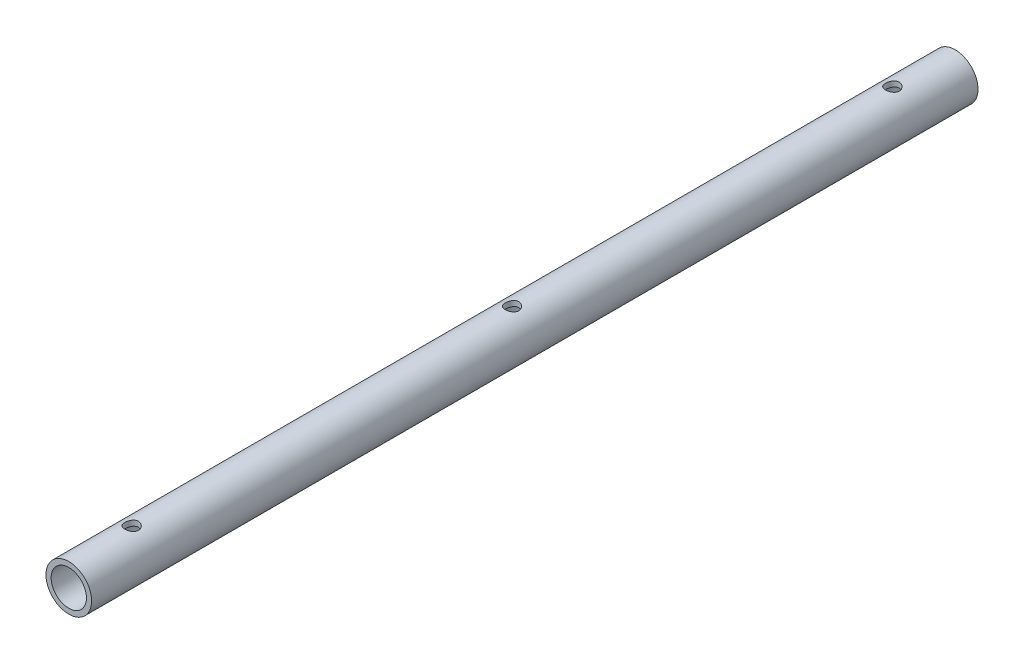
ISO-10303-21;
HEADER;
FILE_DESCRIPTION(('STEP AP214'),'2;1');
FILE_NAME('part.step','',(''),(''),'','','');
FILE_SCHEMA(('AUTOMOTIVE_DESIGN { 1 0 10303 214 1 1 1 1 }'));
ENDSEC;
DATA;
#1=APPLICATION_CONTEXT('core data for automotive mechanical design processes');
#2=APPLICATION_PROTOCOL_DEFINITION('international standard','automotive_design',2000,#1);
#3=PRODUCT_CONTEXT('',#1,'mechanical');
#4=PRODUCT('Part','Part','',(#3));
#5=PRODUCT_RELATED_PRODUCT_CATEGORY('part','',(#4));
#6=PRODUCT_DEFINITION_FORMATION('','',#4);
#7=PRODUCT_DEFINITION_CONTEXT('part definition',#1,'design');
#8=PRODUCT_DEFINITION('design','',#6,#7);
#9=PRODUCT_DEFINITION_SHAPE('','',#8);
#10=(LENGTH_UNIT() NAMED_UNIT(*) SI_UNIT(.MILLI.,.METRE.));
#11=(NAMED_UNIT(*) PLANE_ANGLE_UNIT() SI_UNIT($,.RADIAN.));
#12=(NAMED_UNIT(*) SI_UNIT($,.STERADIAN.) SOLID_ANGLE_UNIT());
#13=UNCERTAINTY_MEASURE_WITH_UNIT(LENGTH_MEASURE(1.E-05),#10,'distance_accuracy_value','');
#14=(GEOMETRIC_REPRESENTATION_CONTEXT(3) GLOBAL_UNCERTAINTY_ASSIGNED_CONTEXT((#13)) GLOBAL_UNIT_ASSIGNED_CONTEXT((#10,
#11,#12)) REPRESENTATION_CONTEXT('',''));
#15=CARTESIAN_POINT('',(0.,0.,0.));
#16=DIRECTION('',(0.,0.,1.));
#17=DIRECTION('',(1.,0.,0.));
#18=AXIS2_PLACEMENT_3D('',#15,#16,#17);
#19=CARTESIAN_POINT('',(0.,0.,207.1624));
#20=DIRECTION('',(0.,0.,1.));
#21=DIRECTION('',(1.,0.,0.));
#22=AXIS2_PLACEMENT_3D('',#19,#20,#21);
#23=PLANE('',#22);
#24=CARTESIAN_POINT('',(0.,0.,207.1624));
#25=DIRECTION('',(0.,0.,1.));
#26=DIRECTION('',(1.,0.,0.));
#27=AXIS2_PLACEMENT_3D('',#24,#25,#26);
#28=CIRCLE('',#27,10.668);
#29=CARTESIAN_POINT('',(10.668,0.,207.1624));
#30=VERTEX_POINT('',#29);
#31=EDGE_CURVE('E10',#30,#30,#28,.T.);
#32=ORIENTED_EDGE('',*,*,#31,.T.);
#33=EDGE_LOOP('',(#32));
#34=FACE_BOUND('',#33,.T.);
#35=CARTESIAN_POINT('',(0.,0.,207.1624));
#36=DIRECTION('',(0.,0.,1.));
#37=DIRECTION('',(1.,0.,0.));
#38=AXIS2_PLACEMENT_3D('',#35,#36,#37);
#39=CIRCLE('',#38,8.255);
#40=CARTESIAN_POINT('',(8.255,0.,207.1624));
#41=VERTEX_POINT('',#40);
#42=EDGE_CURVE('E50',#41,#41,#39,.T.);
#43=ORIENTED_EDGE('',*,*,#42,.F.);
#44=EDGE_LOOP('',(#43));
#45=FACE_BOUND('',#44,.T.);
#46=ADVANCED_FACE('F32',(#34,#45),#23,.T.);
#47=CARTESIAN_POINT('',(0.,0.,-207.1624));
#48=DIRECTION('',(0.,0.,1.));
#49=DIRECTION('',(1.,0.,0.));
#50=AXIS2_PLACEMENT_3D('',#47,#48,#49);
#51=PLANE('',#50);
#52=CARTESIAN_POINT('',(0.,0.,-207.1624));
#53=DIRECTION('',(0.,0.,1.));
#54=DIRECTION('',(1.,0.,0.));
#55=AXIS2_PLACEMENT_3D('',#52,#53,#54);
#56=CIRCLE('',#55,10.668);
#57=CARTESIAN_POINT('',(10.668,0.,-207.1624));
#58=VERTEX_POINT('',#57);
#59=EDGE_CURVE('E45',#58,#58,#56,.T.);
#60=ORIENTED_EDGE('',*,*,#59,.F.);
#61=EDGE_LOOP('',(#60));
#62=FACE_BOUND('',#61,.T.);
#63=CARTESIAN_POINT('',(0.,0.,-207.1624));
#64=DIRECTION('',(0.,0.,1.));
#65=DIRECTION('',(1.,0.,0.));
#66=AXIS2_PLACEMENT_3D('',#63,#64,#65);
#67=CIRCLE('',#66,8.255);
#68=CARTESIAN_POINT('',(8.255,0.,-207.1624));
#69=VERTEX_POINT('',#68);
#70=EDGE_CURVE('E89',#69,#69,#67,.T.);
#71=ORIENTED_EDGE('',*,*,#70,.T.);
#72=EDGE_LOOP('',(#71));
#73=FACE_BOUND('',#72,.T.);
#74=ADVANCED_FACE('F97',(#62,#73),#51,.F.);
#75=CARTESIAN_POINT('',(0.,0.,207.1624));
#76=DIRECTION('',(0.,0.,-1.));
#77=DIRECTION('',(-1.,0.,0.));
#78=AXIS2_PLACEMENT_3D('',#75,#76,#77);
#79=CYLINDRICAL_SURFACE('',#78,10.668);
#80=CARTESIAN_POINT('',(0.,10.668,-174.5996));
#81=CARTESIAN_POINT('',(-0.175570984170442,10.6679984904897,-174.599602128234));
#82=CARTESIAN_POINT('',(-0.351163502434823,10.6636243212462,-174.614095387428));
#83=CARTESIAN_POINT('',(-0.697235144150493,10.646602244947,-174.671547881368));
#84=CARTESIAN_POINT('',(-0.867712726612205,10.6339518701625,-174.714515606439));
#85=CARTESIAN_POINT('',(-1.19851290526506,10.6017635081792,-174.82735330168));
#86=CARTESIAN_POINT('',(-1.35885007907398,10.5822356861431,-174.897183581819));
#87=CARTESIAN_POINT('',(-1.66553975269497,10.5383221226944,-175.061601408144));
#88=CARTESIAN_POINT('',(-1.81189038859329,10.5139357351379,-175.156192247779));
#89=CARTESIAN_POINT('',(-2.09065446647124,10.462123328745,-175.370307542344));
#90=CARTESIAN_POINT('',(-2.22260967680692,10.4346350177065,-175.49041347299));
#91=CARTESIAN_POINT('',(-2.46483971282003,10.380088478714,-175.750910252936));
#92=CARTESIAN_POINT('',(-2.57511089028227,10.353030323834,-175.89130450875));
#93=CARTESIAN_POINT('',(-2.77325408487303,10.3017486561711,-176.192269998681));
#94=CARTESIAN_POINT('',(-2.86056678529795,10.2776025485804,-176.35322389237));
#95=CARTESIAN_POINT('',(-3.00669887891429,10.235809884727,-176.688371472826));
#96=CARTESIAN_POINT('',(-3.06552511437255,10.2181617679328,-176.862561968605));
#97=CARTESIAN_POINT('',(-3.15136205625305,10.1920124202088,-177.214092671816));
#98=CARTESIAN_POINT('',(-3.17921753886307,10.1832688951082,-177.391208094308));
#99=CARTESIAN_POINT('',(-3.20496015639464,10.175197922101,-177.747797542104));
#100=CARTESIAN_POINT('',(-3.20285455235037,10.1758681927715,-177.927270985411));
#101=CARTESIAN_POINT('',(-3.16939830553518,10.1863343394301,-178.276611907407));
#102=CARTESIAN_POINT('',(-3.13910605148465,10.1957999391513,-178.446592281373));
#103=CARTESIAN_POINT('',(-3.05184640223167,10.2222558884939,-178.778937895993));
#104=CARTESIAN_POINT('',(-2.99487637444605,10.2392469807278,-178.941302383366));
#105=CARTESIAN_POINT('',(-2.85509874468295,10.2791030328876,-179.256396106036));
#106=CARTESIAN_POINT('',(-2.77194787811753,10.30204527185,-179.408962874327));
#107=CARTESIAN_POINT('',(-2.58240750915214,10.3511814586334,-179.698332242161));
#108=CARTESIAN_POINT('',(-2.47601237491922,10.3773761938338,-179.835131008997));
#109=CARTESIAN_POINT('',(-2.23774721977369,10.4314053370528,-180.09508405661));
#110=CARTESIAN_POINT('',(-2.10499889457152,10.4592625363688,-180.217429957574));
#111=CARTESIAN_POINT('',(-1.82052249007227,10.5125084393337,-180.438311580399));
#112=CARTESIAN_POINT('',(-1.66879321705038,10.5378969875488,-180.536845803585));
#113=CARTESIAN_POINT('',(-1.3491927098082,10.5835768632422,-180.707797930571));
#114=CARTESIAN_POINT('',(-1.18122016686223,10.6038329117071,-180.780036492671));
#115=CARTESIAN_POINT('',(-0.834761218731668,10.6367112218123,-180.894999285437));
#116=CARTESIAN_POINT('',(-0.656277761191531,10.6493356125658,-180.937731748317));
#117=CARTESIAN_POINT('',(-0.300735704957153,10.6651914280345,-180.991123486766));
#118=CARTESIAN_POINT('',(-0.123855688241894,10.668743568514,-181.002878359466));
#119=CARTESIAN_POINT('',(0.229361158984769,10.6669955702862,-180.997052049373));
#120=CARTESIAN_POINT('',(0.40569805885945,10.6616966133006,-180.979474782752));
#121=CARTESIAN_POINT('',(0.748687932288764,10.6430517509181,-180.916368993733));
#122=CARTESIAN_POINT('',(0.915469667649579,10.6298902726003,-180.871480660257));
#123=CARTESIAN_POINT('',(1.23909809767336,10.597043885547,-180.755797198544));
#124=CARTESIAN_POINT('',(1.39594359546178,10.5773581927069,-180.68499895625));
#125=CARTESIAN_POINT('',(1.6992783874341,10.5329357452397,-180.517666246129));
#126=CARTESIAN_POINT('',(1.8454441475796,10.5080926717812,-180.420574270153));
#127=CARTESIAN_POINT('',(2.11978132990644,10.4562075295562,-180.204087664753));
#128=CARTESIAN_POINT('',(2.24794822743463,10.4291649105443,-180.084687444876));
#129=CARTESIAN_POINT('',(2.48747344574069,10.3746976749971,-179.821826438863));
#130=CARTESIAN_POINT('',(2.59805231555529,10.3472948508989,-179.677649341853));
#131=CARTESIAN_POINT('',(2.79350103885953,10.2962525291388,-179.372190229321));
#132=CARTESIAN_POINT('',(2.87837156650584,10.2726129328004,-179.210908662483));
#133=CARTESIAN_POINT('',(3.01941411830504,10.2320455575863,-178.876331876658));
#134=CARTESIAN_POINT('',(3.07571981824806,10.2150866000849,-178.703097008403));
#135=CARTESIAN_POINT('',(3.15819164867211,10.1898942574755,-178.34900094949));
#136=CARTESIAN_POINT('',(3.18436810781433,10.1816578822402,-178.168142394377));
#137=CARTESIAN_POINT('',(3.20513626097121,10.1751378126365,-177.812030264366));
#138=CARTESIAN_POINT('',(3.20099858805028,10.1764537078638,-177.636857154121));
#139=CARTESIAN_POINT('',(3.16428893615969,10.1879272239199,-177.289826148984));
#140=CARTESIAN_POINT('',(3.13171809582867,10.1980844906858,-177.117968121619));
#141=CARTESIAN_POINT('',(3.03988689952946,10.2258276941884,-176.784522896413));
#142=CARTESIAN_POINT('',(2.98096298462,10.2433198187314,-176.622834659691));
#143=CARTESIAN_POINT('',(2.83836023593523,10.2837445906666,-176.311510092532));
#144=CARTESIAN_POINT('',(2.75467666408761,10.306678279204,-176.1618760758));
#145=CARTESIAN_POINT('',(2.56136042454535,10.3564448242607,-175.87301117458));
#146=CARTESIAN_POINT('',(2.4508935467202,10.3833892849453,-175.734357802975));
#147=CARTESIAN_POINT('',(2.20864798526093,10.4375993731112,-175.47714434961));
#148=CARTESIAN_POINT('',(2.07686377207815,10.464865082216,-175.358589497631));
#149=CARTESIAN_POINT('',(1.7910841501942,10.5176011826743,-175.141484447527));
#150=CARTESIAN_POINT('',(1.63655203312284,10.5429957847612,-175.043620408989));
#151=CARTESIAN_POINT('',(1.31246563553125,10.5882178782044,-174.875399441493));
#152=CARTESIAN_POINT('',(1.14291842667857,10.608047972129,-174.805029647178));
#153=CARTESIAN_POINT('',(0.81238465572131,10.6381760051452,-174.700102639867));
#154=CARTESIAN_POINT('',(0.652427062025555,10.6492675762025,-174.662516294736));
#155=CARTESIAN_POINT('',(0.328318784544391,10.6641796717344,-174.612266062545));
#156=CARTESIAN_POINT('',(0.164168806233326,10.6680014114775,-174.599598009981));
#157=CARTESIAN_POINT('',(0.,10.668,-174.5996));
#158=B_SPLINE_CURVE_WITH_KNOTS('',3,(#80,#81,#82,#83,#84,#85,#86,#87,#88,#89,#90,#91,#92,#93,
#94,#95,#96,#97,#98,#99,#100,#101,#102,#103,#104,#105,#106,#107,#108,#109,#110,#111,#112,#113,
#114,#115,#116,#117,#118,#119,#120,#121,#122,#123,#124,#125,#126,#127,#128,#129,#130,#131,#132,
#133,#134,#135,#136,#137,#138,#139,#140,#141,#142,#143,#144,#145,#146,#147,#148,#149,#150,#151,
#152,#153,#154,#155,#156,#157),.UNSPECIFIED.,.T.,.F.,(4,2,2,2,2,2,2,2,2,2,2,2,2,2,2,2,2,2,2,2,2,
2,2,2,2,2,2,2,2,2,2,2,2,2,2,2,2,2,4),(0.,0.526109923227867,1.05237678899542,1.57786905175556,
2.10343124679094,2.64258314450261,3.18182567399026,3.73319151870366,4.28442486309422,
4.82022249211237,5.35589027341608,5.87222229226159,6.38860527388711,6.91206233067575,
7.43564635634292,7.98109573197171,8.52657942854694,9.0757166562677,9.62470061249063,
10.1539903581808,10.6832094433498,11.2004771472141,11.7178070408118,12.2471052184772,
12.7765362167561,13.3251939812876,13.8738373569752,14.4198889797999,14.9657533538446,
15.4888725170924,16.0119707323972,16.5285733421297,17.0452748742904,17.5807984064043,
18.1164610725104,18.667783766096,19.2188481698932,19.7108729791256,20.2028155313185),.UNSPECIFIED.);
#159=CARTESIAN_POINT('',(0.,10.668,-174.5996));
#160=VERTEX_POINT('',#159);
#161=EDGE_CURVE('E191',#160,#160,#158,.T.);
#162=ORIENTED_EDGE('',*,*,#161,.T.);
#163=EDGE_LOOP('',(#162));
#164=FACE_BOUND('',#163,.T.);
#165=CARTESIAN_POINT('',(0.,-10.668,-174.5996));
#166=CARTESIAN_POINT('',(0.175570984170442,-10.6679984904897,-174.599602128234));
#167=CARTESIAN_POINT('',(0.351163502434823,-10.6636243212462,-174.614095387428));
#168=CARTESIAN_POINT('',(0.697235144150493,-10.646602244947,-174.671547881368));
#169=CARTESIAN_POINT('',(0.867712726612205,-10.6339518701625,-174.714515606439));
#170=CARTESIAN_POINT('',(1.19851290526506,-10.6017635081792,-174.82735330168));
#171=CARTESIAN_POINT('',(1.35885007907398,-10.5822356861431,-174.897183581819));
#172=CARTESIAN_POINT('',(1.66553975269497,-10.5383221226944,-175.061601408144));
#173=CARTESIAN_POINT('',(1.81189038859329,-10.5139357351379,-175.156192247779));
#174=CARTESIAN_POINT('',(2.09065446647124,-10.462123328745,-175.370307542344));
#175=CARTESIAN_POINT('',(2.22260967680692,-10.4346350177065,-175.49041347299));
#176=CARTESIAN_POINT('',(2.46483971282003,-10.380088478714,-175.750910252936));
#177=CARTESIAN_POINT('',(2.57511089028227,-10.353030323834,-175.89130450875));
#178=CARTESIAN_POINT('',(2.77325408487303,-10.3017486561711,-176.192269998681));
#179=CARTESIAN_POINT('',(2.86056678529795,-10.2776025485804,-176.35322389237));
#180=CARTESIAN_POINT('',(3.00669887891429,-10.235809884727,-176.688371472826));
#181=CARTESIAN_POINT('',(3.06552511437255,-10.2181617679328,-176.862561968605));
#182=CARTESIAN_POINT('',(3.15136205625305,-10.1920124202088,-177.214092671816));
#183=CARTESIAN_POINT('',(3.17921753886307,-10.1832688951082,-177.391208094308));
#184=CARTESIAN_POINT('',(3.20496015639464,-10.175197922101,-177.747797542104));
#185=CARTESIAN_POINT('',(3.20285455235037,-10.1758681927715,-177.927270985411));
#186=CARTESIAN_POINT('',(3.16939830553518,-10.1863343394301,-178.276611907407));
#187=CARTESIAN_POINT('',(3.13910605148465,-10.1957999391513,-178.446592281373));
#188=CARTESIAN_POINT('',(3.05184640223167,-10.2222558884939,-178.778937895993));
#189=CARTESIAN_POINT('',(2.99487637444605,-10.2392469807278,-178.941302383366));
#190=CARTESIAN_POINT('',(2.85509874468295,-10.2791030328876,-179.256396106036));
#191=CARTESIAN_POINT('',(2.77194787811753,-10.30204527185,-179.408962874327));
#192=CARTESIAN_POINT('',(2.58240750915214,-10.3511814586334,-179.698332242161));
#193=CARTESIAN_POINT('',(2.47601237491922,-10.3773761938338,-179.835131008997));
#194=CARTESIAN_POINT('',(2.23774721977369,-10.4314053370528,-180.09508405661));
#195=CARTESIAN_POINT('',(2.10499889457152,-10.4592625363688,-180.217429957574));
#196=CARTESIAN_POINT('',(1.82052249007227,-10.5125084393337,-180.438311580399));
#197=CARTESIAN_POINT('',(1.66879321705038,-10.5378969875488,-180.536845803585));
#198=CARTESIAN_POINT('',(1.3491927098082,-10.5835768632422,-180.707797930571));
#199=CARTESIAN_POINT('',(1.18122016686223,-10.6038329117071,-180.780036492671));
#200=CARTESIAN_POINT('',(0.834761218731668,-10.6367112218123,-180.894999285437));
#201=CARTESIAN_POINT('',(0.656277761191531,-10.6493356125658,-180.937731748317));
#202=CARTESIAN_POINT('',(0.300735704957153,-10.6651914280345,-180.991123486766));
#203=CARTESIAN_POINT('',(0.123855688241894,-10.668743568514,-181.002878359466));
#204=CARTESIAN_POINT('',(-0.229361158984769,-10.6669955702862,-180.997052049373));
#205=CARTESIAN_POINT('',(-0.40569805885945,-10.6616966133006,-180.979474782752));
#206=CARTESIAN_POINT('',(-0.748687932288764,-10.6430517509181,-180.916368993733));
#207=CARTESIAN_POINT('',(-0.915469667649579,-10.6298902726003,-180.871480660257));
#208=CARTESIAN_POINT('',(-1.23909809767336,-10.597043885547,-180.755797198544));
#209=CARTESIAN_POINT('',(-1.39594359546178,-10.5773581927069,-180.68499895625));
#210=CARTESIAN_POINT('',(-1.6992783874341,-10.5329357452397,-180.517666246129));
#211=CARTESIAN_POINT('',(-1.8454441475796,-10.5080926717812,-180.420574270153));
#212=CARTESIAN_POINT('',(-2.11978132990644,-10.4562075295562,-180.204087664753));
#213=CARTESIAN_POINT('',(-2.24794822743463,-10.4291649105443,-180.084687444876));
#214=CARTESIAN_POINT('',(-2.48747344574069,-10.3746976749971,-179.821826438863));
#215=CARTESIAN_POINT('',(-2.59805231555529,-10.3472948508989,-179.677649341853));
#216=CARTESIAN_POINT('',(-2.79350103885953,-10.2962525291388,-179.372190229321));
#217=CARTESIAN_POINT('',(-2.87837156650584,-10.2726129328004,-179.210908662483));
#218=CARTESIAN_POINT('',(-3.01941411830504,-10.2320455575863,-178.876331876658));
#219=CARTESIAN_POINT('',(-3.07571981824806,-10.2150866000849,-178.703097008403));
#220=CARTESIAN_POINT('',(-3.15819164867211,-10.1898942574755,-178.34900094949));
#221=CARTESIAN_POINT('',(-3.18436810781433,-10.1816578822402,-178.168142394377));
#222=CARTESIAN_POINT('',(-3.20513626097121,-10.1751378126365,-177.812030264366));
#223=CARTESIAN_POINT('',(-3.20099858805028,-10.1764537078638,-177.636857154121));
#224=CARTESIAN_POINT('',(-3.16428893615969,-10.1879272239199,-177.289826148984));
#225=CARTESIAN_POINT('',(-3.13171809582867,-10.1980844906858,-177.117968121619));
#226=CARTESIAN_POINT('',(-3.03988689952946,-10.2258276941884,-176.784522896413));
#227=CARTESIAN_POINT('',(-2.98096298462,-10.2433198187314,-176.622834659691));
#228=CARTESIAN_POINT('',(-2.83836023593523,-10.2837445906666,-176.311510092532));
#229=CARTESIAN_POINT('',(-2.75467666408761,-10.306678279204,-176.1618760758));
#230=CARTESIAN_POINT('',(-2.56136042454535,-10.3564448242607,-175.87301117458));
#231=CARTESIAN_POINT('',(-2.4508935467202,-10.3833892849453,-175.734357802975));
#232=CARTESIAN_POINT('',(-2.20864798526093,-10.4375993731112,-175.47714434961));
#233=CARTESIAN_POINT('',(-2.07686377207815,-10.464865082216,-175.358589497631));
#234=CARTESIAN_POINT('',(-1.7910841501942,-10.5176011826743,-175.141484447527));
#235=CARTESIAN_POINT('',(-1.63655203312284,-10.5429957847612,-175.043620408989));
#236=CARTESIAN_POINT('',(-1.31246563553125,-10.5882178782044,-174.875399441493));
#237=CARTESIAN_POINT('',(-1.14291842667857,-10.608047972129,-174.805029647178));
#238=CARTESIAN_POINT('',(-0.81238465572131,-10.6381760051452,-174.700102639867));
#239=CARTESIAN_POINT('',(-0.652427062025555,-10.6492675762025,-174.662516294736));
#240=CARTESIAN_POINT('',(-0.328318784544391,-10.6641796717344,-174.612266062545));
#241=CARTESIAN_POINT('',(-0.164168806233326,-10.6680014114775,-174.599598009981));
#242=CARTESIAN_POINT('',(0.,-10.668,-174.5996));
#243=B_SPLINE_CURVE_WITH_KNOTS('',3,(#165,#166,#167,#168,#169,#170,#171,#172,#173,#174,#175,
#176,#177,#178,#179,#180,#181,#182,#183,#184,#185,#186,#187,#188,#189,#190,#191,#192,#193,#194,
#195,#196,#197,#198,#199,#200,#201,#202,#203,#204,#205,#206,#207,#208,#209,#210,#211,#212,#213,
#214,#215,#216,#217,#218,#219,#220,#221,#222,#223,#224,#225,#226,#227,#228,#229,#230,#231,#232,
#233,#234,#235,#236,#237,#238,#239,#240,#241,#242),.UNSPECIFIED.,.T.,.F.,(4,2,2,2,2,2,2,2,2,2,2,
2,2,2,2,2,2,2,2,2,2,2,2,2,2,2,2,2,2,2,2,2,2,2,2,2,2,2,4),(0.,0.526109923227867,1.05237678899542,
1.57786905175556,2.10343124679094,2.64258314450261,3.18182567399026,3.73319151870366,
4.28442486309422,4.82022249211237,5.35589027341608,5.87222229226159,6.38860527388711,
6.91206233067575,7.43564635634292,7.98109573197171,8.52657942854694,9.0757166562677,
9.62470061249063,10.1539903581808,10.6832094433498,11.2004771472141,11.7178070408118,
12.2471052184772,12.7765362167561,13.3251939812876,13.8738373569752,14.4198889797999,
14.9657533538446,15.4888725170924,16.0119707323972,16.5285733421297,17.0452748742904,
17.5807984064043,18.1164610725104,18.667783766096,19.2188481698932,19.7108729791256,
20.2028155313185),.UNSPECIFIED.);
#244=CARTESIAN_POINT('',(0.,-10.668,-174.5996));
#245=VERTEX_POINT('',#244);
#246=EDGE_CURVE('E168',#245,#245,#243,.T.);
#247=ORIENTED_EDGE('',*,*,#246,.T.);
#248=EDGE_LOOP('',(#247));
#249=FACE_BOUND('',#248,.T.);
#250=CARTESIAN_POINT('',(0.,10.668,181.0004));
#251=CARTESIAN_POINT('',(-0.175570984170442,10.6679984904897,181.000397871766));
#252=CARTESIAN_POINT('',(-0.351163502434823,10.6636243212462,180.985904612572));
#253=CARTESIAN_POINT('',(-0.697235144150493,10.646602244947,180.928452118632));
#254=CARTESIAN_POINT('',(-0.867712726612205,10.6339518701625,180.885484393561));
#255=CARTESIAN_POINT('',(-1.19851290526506,10.6017635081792,180.77264669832));
#256=CARTESIAN_POINT('',(-1.35885007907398,10.5822356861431,180.702816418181));
#257=CARTESIAN_POINT('',(-1.66553975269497,10.5383221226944,180.538398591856));
#258=CARTESIAN_POINT('',(-1.81189038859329,10.5139357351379,180.443807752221));
#259=CARTESIAN_POINT('',(-2.09065446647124,10.462123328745,180.229692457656));
#260=CARTESIAN_POINT('',(-2.22260967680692,10.4346350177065,180.10958652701));
#261=CARTESIAN_POINT('',(-2.46483971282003,10.380088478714,179.849089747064));
#262=CARTESIAN_POINT('',(-2.57511089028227,10.353030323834,179.70869549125));
#263=CARTESIAN_POINT('',(-2.77325408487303,10.3017486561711,179.407730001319));
#264=CARTESIAN_POINT('',(-2.86056678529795,10.2776025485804,179.24677610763));
#265=CARTESIAN_POINT('',(-3.00669887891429,10.235809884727,178.911628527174));
#266=CARTESIAN_POINT('',(-3.06552511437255,10.2181617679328,178.737438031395));
#267=CARTESIAN_POINT('',(-3.15136205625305,10.1920124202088,178.385907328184));
#268=CARTESIAN_POINT('',(-3.17921753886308,10.1832688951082,178.208791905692));
#269=CARTESIAN_POINT('',(-3.20496015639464,10.175197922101,177.852202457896));
#270=CARTESIAN_POINT('',(-3.20285455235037,10.1758681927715,177.672729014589));
#271=CARTESIAN_POINT('',(-3.16939830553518,10.1863343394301,177.323388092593));
#272=CARTESIAN_POINT('',(-3.13910605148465,10.1957999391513,177.153407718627));
#273=CARTESIAN_POINT('',(-3.05184640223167,10.2222558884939,176.821062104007));
#274=CARTESIAN_POINT('',(-2.99487637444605,10.2392469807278,176.658697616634));
#275=CARTESIAN_POINT('',(-2.85509874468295,10.2791030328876,176.343603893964));
#276=CARTESIAN_POINT('',(-2.77194787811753,10.30204527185,176.191037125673));
#277=CARTESIAN_POINT('',(-2.58240750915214,10.3511814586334,175.901667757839));
#278=CARTESIAN_POINT('',(-2.47601237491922,10.3773761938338,175.764868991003));
#279=CARTESIAN_POINT('',(-2.2377472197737,10.4314053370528,175.50491594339));
#280=CARTESIAN_POINT('',(-2.10499889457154,10.4592625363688,175.382570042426));
#281=CARTESIAN_POINT('',(-1.8205224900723,10.5125084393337,175.1616884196));
#282=CARTESIAN_POINT('',(-1.6687932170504,10.5378969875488,175.063154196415));
#283=CARTESIAN_POINT('',(-1.3491927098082,10.5835768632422,174.892202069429));
#284=CARTESIAN_POINT('',(-1.18122016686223,10.6038329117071,174.819963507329));
#285=CARTESIAN_POINT('',(-0.834761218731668,10.6367112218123,174.705000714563));
#286=CARTESIAN_POINT('',(-0.656277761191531,10.6493356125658,174.662268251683));
#287=CARTESIAN_POINT('',(-0.300735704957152,10.6651914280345,174.608876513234));
#288=CARTESIAN_POINT('',(-0.123855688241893,10.668743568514,174.597121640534));
#289=CARTESIAN_POINT('',(0.22936115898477,10.6669955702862,174.602947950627));
#290=CARTESIAN_POINT('',(0.40569805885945,10.6616966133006,174.620525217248));
#291=CARTESIAN_POINT('',(0.74868793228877,10.6430517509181,174.683631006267));
#292=CARTESIAN_POINT('',(0.915469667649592,10.6298902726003,174.728519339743));
#293=CARTESIAN_POINT('',(1.23909809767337,10.597043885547,174.844202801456));
#294=CARTESIAN_POINT('',(1.39594359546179,10.5773581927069,174.91500104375));
#295=CARTESIAN_POINT('',(1.6992783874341,10.5329357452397,175.082333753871));
#296=CARTESIAN_POINT('',(1.8454441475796,10.5080926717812,175.179425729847));
#297=CARTESIAN_POINT('',(2.11978132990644,10.4562075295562,175.395912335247));
#298=CARTESIAN_POINT('',(2.24794822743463,10.4291649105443,175.515312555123));
#299=CARTESIAN_POINT('',(2.48747344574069,10.3746976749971,175.778173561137));
#300=CARTESIAN_POINT('',(2.59805231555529,10.3472948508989,175.922350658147));
#301=CARTESIAN_POINT('',(2.79350103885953,10.2962525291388,176.227809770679));
#302=CARTESIAN_POINT('',(2.87837156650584,10.2726129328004,176.389091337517));
#303=CARTESIAN_POINT('',(3.01941411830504,10.2320455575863,176.723668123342));
#304=CARTESIAN_POINT('',(3.07571981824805,10.2150866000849,176.896902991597));
#305=CARTESIAN_POINT('',(3.1581916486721,10.1898942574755,177.25099905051));
#306=CARTESIAN_POINT('',(3.18436810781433,10.1816578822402,177.431857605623));
#307=CARTESIAN_POINT('',(3.20513626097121,10.1751378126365,177.787969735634));
#308=CARTESIAN_POINT('',(3.20099858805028,10.1764537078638,177.963142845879));
#309=CARTESIAN_POINT('',(3.16428893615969,10.1879272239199,178.310173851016));
#310=CARTESIAN_POINT('',(3.13171809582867,10.1980844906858,178.482031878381));
#311=CARTESIAN_POINT('',(3.03988689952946,10.2258276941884,178.815477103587));
#312=CARTESIAN_POINT('',(2.98096298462,10.2433198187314,178.977165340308));
#313=CARTESIAN_POINT('',(2.83836023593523,10.2837445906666,179.288489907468));
#314=CARTESIAN_POINT('',(2.75467666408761,10.306678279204,179.4381239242));
#315=CARTESIAN_POINT('',(2.56136042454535,10.3564448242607,179.72698882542));
#316=CARTESIAN_POINT('',(2.4508935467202,10.3833892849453,179.865642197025));
#317=CARTESIAN_POINT('',(2.20864798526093,10.4375993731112,180.12285565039));
#318=CARTESIAN_POINT('',(2.07686377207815,10.464865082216,180.241410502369));
#319=CARTESIAN_POINT('',(1.7910841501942,10.5176011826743,180.458515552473));
#320=CARTESIAN_POINT('',(1.63655203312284,10.5429957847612,180.556379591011));
#321=CARTESIAN_POINT('',(1.31246563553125,10.5882178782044,180.724600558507));
#322=CARTESIAN_POINT('',(1.14291842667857,10.608047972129,180.794970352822));
#323=CARTESIAN_POINT('',(0.81238465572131,10.6381760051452,180.899897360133));
#324=CARTESIAN_POINT('',(0.652427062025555,10.6492675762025,180.937483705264));
#325=CARTESIAN_POINT('',(0.328318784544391,10.6641796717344,180.987733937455));
#326=CARTESIAN_POINT('',(0.164168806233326,10.6680014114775,181.000401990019));
#327=CARTESIAN_POINT('',(0.,10.668,181.0004));
#328=B_SPLINE_CURVE_WITH_KNOTS('',3,(#250,#251,#252,#253,#254,#255,#256,#257,#258,#259,#260,
#261,#262,#263,#264,#265,#266,#267,#268,#269,#270,#271,#272,#273,#274,#275,#276,#277,#278,#279,
#280,#281,#282,#283,#284,#285,#286,#287,#288,#289,#290,#291,#292,#293,#294,#295,#296,#297,#298,
#299,#300,#301,#302,#303,#304,#305,#306,#307,#308,#309,#310,#311,#312,#313,#314,#315,#316,#317,
#318,#319,#320,#321,#322,#323,#324,#325,#326,#327),.UNSPECIFIED.,.T.,.F.,(4,2,2,2,2,2,2,2,2,2,2,
2,2,2,2,2,2,2,2,2,2,2,2,2,2,2,2,2,2,2,2,2,2,2,2,2,2,2,4),(0.,0.526109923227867,1.05237678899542,
1.57786905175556,2.10343124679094,2.64258314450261,3.18182567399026,3.73319151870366,
4.28442486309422,4.8202224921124,5.35589027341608,5.87222229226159,6.38860527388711,
6.91206233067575,7.43564635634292,7.98109573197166,8.52657942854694,9.0757166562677,
9.62470061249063,10.1539903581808,10.6832094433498,11.2004771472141,11.7178070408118,
12.2471052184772,12.7765362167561,13.3251939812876,13.8738373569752,14.4198889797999,
14.9657533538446,15.4888725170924,16.0119707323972,16.5285733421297,17.0452748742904,
17.5807984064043,18.1164610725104,18.667783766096,19.2188481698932,19.7108729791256,
20.2028155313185),.UNSPECIFIED.);
#329=CARTESIAN_POINT('',(0.,10.668,181.0004));
#330=VERTEX_POINT('',#329);
#331=EDGE_CURVE('E144',#330,#330,#328,.T.);
#332=ORIENTED_EDGE('',*,*,#331,.T.);
#333=EDGE_LOOP('',(#332));
#334=FACE_BOUND('',#333,.T.);
#335=CARTESIAN_POINT('',(0.,-10.668,181.0004));
#336=CARTESIAN_POINT('',(0.175570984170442,-10.6679984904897,181.000397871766));
#337=CARTESIAN_POINT('',(0.351163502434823,-10.6636243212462,180.985904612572));
#338=CARTESIAN_POINT('',(0.697235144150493,-10.646602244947,180.928452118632));
#339=CARTESIAN_POINT('',(0.867712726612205,-10.6339518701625,180.885484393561));
#340=CARTESIAN_POINT('',(1.19851290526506,-10.6017635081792,180.77264669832));
#341=CARTESIAN_POINT('',(1.35885007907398,-10.5822356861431,180.702816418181));
#342=CARTESIAN_POINT('',(1.66553975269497,-10.5383221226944,180.538398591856));
#343=CARTESIAN_POINT('',(1.81189038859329,-10.5139357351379,180.443807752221));
#344=CARTESIAN_POINT('',(2.09065446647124,-10.462123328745,180.229692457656));
#345=CARTESIAN_POINT('',(2.22260967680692,-10.4346350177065,180.10958652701));
#346=CARTESIAN_POINT('',(2.46483971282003,-10.380088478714,179.849089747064));
#347=CARTESIAN_POINT('',(2.57511089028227,-10.353030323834,179.70869549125));
#348=CARTESIAN_POINT('',(2.77325408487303,-10.3017486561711,179.407730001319));
#349=CARTESIAN_POINT('',(2.86056678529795,-10.2776025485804,179.24677610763));
#350=CARTESIAN_POINT('',(3.00669887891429,-10.235809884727,178.911628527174));
#351=CARTESIAN_POINT('',(3.06552511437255,-10.2181617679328,178.737438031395));
#352=CARTESIAN_POINT('',(3.15136205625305,-10.1920124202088,178.385907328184));
#353=CARTESIAN_POINT('',(3.17921753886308,-10.1832688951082,178.208791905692));
#354=CARTESIAN_POINT('',(3.20496015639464,-10.175197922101,177.852202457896));
#355=CARTESIAN_POINT('',(3.20285455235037,-10.1758681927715,177.672729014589));
#356=CARTESIAN_POINT('',(3.16939830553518,-10.1863343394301,177.323388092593));
#357=CARTESIAN_POINT('',(3.13910605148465,-10.1957999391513,177.153407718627));
#358=CARTESIAN_POINT('',(3.05184640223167,-10.2222558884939,176.821062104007));
#359=CARTESIAN_POINT('',(2.99487637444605,-10.2392469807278,176.658697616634));
#360=CARTESIAN_POINT('',(2.85509874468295,-10.2791030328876,176.343603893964));
#361=CARTESIAN_POINT('',(2.77194787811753,-10.30204527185,176.191037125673));
#362=CARTESIAN_POINT('',(2.58240750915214,-10.3511814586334,175.901667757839));
#363=CARTESIAN_POINT('',(2.47601237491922,-10.3773761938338,175.764868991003));
#364=CARTESIAN_POINT('',(2.2377472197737,-10.4314053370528,175.50491594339));
#365=CARTESIAN_POINT('',(2.10499889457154,-10.4592625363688,175.382570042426));
#366=CARTESIAN_POINT('',(1.8205224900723,-10.5125084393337,175.1616884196));
#367=CARTESIAN_POINT('',(1.6687932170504,-10.5378969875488,175.063154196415));
#368=CARTESIAN_POINT('',(1.3491927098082,-10.5835768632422,174.892202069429));
#369=CARTESIAN_POINT('',(1.18122016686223,-10.6038329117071,174.819963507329));
#370=CARTESIAN_POINT('',(0.834761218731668,-10.6367112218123,174.705000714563));
#371=CARTESIAN_POINT('',(0.656277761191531,-10.6493356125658,174.662268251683));
#372=CARTESIAN_POINT('',(0.300735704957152,-10.6651914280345,174.608876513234));
#373=CARTESIAN_POINT('',(0.123855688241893,-10.668743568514,174.597121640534));
#374=CARTESIAN_POINT('',(-0.22936115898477,-10.6669955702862,174.602947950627));
#375=CARTESIAN_POINT('',(-0.40569805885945,-10.6616966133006,174.620525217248));
#376=CARTESIAN_POINT('',(-0.74868793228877,-10.6430517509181,174.683631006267));
#377=CARTESIAN_POINT('',(-0.915469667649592,-10.6298902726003,174.728519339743));
#378=CARTESIAN_POINT('',(-1.23909809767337,-10.597043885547,174.844202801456));
#379=CARTESIAN_POINT('',(-1.39594359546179,-10.5773581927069,174.91500104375));
#380=CARTESIAN_POINT('',(-1.6992783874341,-10.5329357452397,175.082333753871));
#381=CARTESIAN_POINT('',(-1.8454441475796,-10.5080926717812,175.179425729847));
#382=CARTESIAN_POINT('',(-2.11978132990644,-10.4562075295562,175.395912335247));
#383=CARTESIAN_POINT('',(-2.24794822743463,-10.4291649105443,175.515312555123));
#384=CARTESIAN_POINT('',(-2.48747344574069,-10.3746976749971,175.778173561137));
#385=CARTESIAN_POINT('',(-2.59805231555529,-10.3472948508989,175.922350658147));
#386=CARTESIAN_POINT('',(-2.79350103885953,-10.2962525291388,176.227809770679));
#387=CARTESIAN_POINT('',(-2.87837156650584,-10.2726129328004,176.389091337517));
#388=CARTESIAN_POINT('',(-3.01941411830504,-10.2320455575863,176.723668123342));
#389=CARTESIAN_POINT('',(-3.07571981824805,-10.2150866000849,176.896902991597));
#390=CARTESIAN_POINT('',(-3.1581916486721,-10.1898942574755,177.25099905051));
#391=CARTESIAN_POINT('',(-3.18436810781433,-10.1816578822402,177.431857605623));
#392=CARTESIAN_POINT('',(-3.20513626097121,-10.1751378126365,177.787969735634));
#393=CARTESIAN_POINT('',(-3.20099858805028,-10.1764537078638,177.963142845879));
#394=CARTESIAN_POINT('',(-3.16428893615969,-10.1879272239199,178.310173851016));
#395=CARTESIAN_POINT('',(-3.13171809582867,-10.1980844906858,178.482031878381));
#396=CARTESIAN_POINT('',(-3.03988689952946,-10.2258276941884,178.815477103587));
#397=CARTESIAN_POINT('',(-2.98096298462,-10.2433198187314,178.977165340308));
#398=CARTESIAN_POINT('',(-2.83836023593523,-10.2837445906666,179.288489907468));
#399=CARTESIAN_POINT('',(-2.75467666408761,-10.306678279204,179.4381239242));
#400=CARTESIAN_POINT('',(-2.56136042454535,-10.3564448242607,179.72698882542));
#401=CARTESIAN_POINT('',(-2.4508935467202,-10.3833892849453,179.865642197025));
#402=CARTESIAN_POINT('',(-2.20864798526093,-10.4375993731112,180.12285565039));
#403=CARTESIAN_POINT('',(-2.07686377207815,-10.464865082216,180.241410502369));
#404=CARTESIAN_POINT('',(-1.7910841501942,-10.5176011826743,180.458515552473));
#405=CARTESIAN_POINT('',(-1.63655203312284,-10.5429957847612,180.556379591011));
#406=CARTESIAN_POINT('',(-1.31246563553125,-10.5882178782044,180.724600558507));
#407=CARTESIAN_POINT('',(-1.14291842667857,-10.608047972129,180.794970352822));
#408=CARTESIAN_POINT('',(-0.81238465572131,-10.6381760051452,180.899897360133));
#409=CARTESIAN_POINT('',(-0.652427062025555,-10.6492675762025,180.937483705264));
#410=CARTESIAN_POINT('',(-0.328318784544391,-10.6641796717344,180.987733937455));
#411=CARTESIAN_POINT('',(-0.164168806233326,-10.6680014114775,181.000401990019));
#412=CARTESIAN_POINT('',(0.,-10.668,181.0004));
#413=B_SPLINE_CURVE_WITH_KNOTS('',3,(#335,#336,#337,#338,#339,#340,#341,#342,#343,#344,#345,
#346,#347,#348,#349,#350,#351,#352,#353,#354,#355,#356,#357,#358,#359,#360,#361,#362,#363,#364,
#365,#366,#367,#368,#369,#370,#371,#372,#373,#374,#375,#376,#377,#378,#379,#380,#381,#382,#383,
#384,#385,#386,#387,#388,#389,#390,#391,#392,#393,#394,#395,#396,#397,#398,#399,#400,#401,#402,
#403,#404,#405,#406,#407,#408,#409,#410,#411,#412),.UNSPECIFIED.,.T.,.F.,(4,2,2,2,2,2,2,2,2,2,2,
2,2,2,2,2,2,2,2,2,2,2,2,2,2,2,2,2,2,2,2,2,2,2,2,2,2,2,4),(0.,0.526109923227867,1.05237678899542,
1.57786905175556,2.10343124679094,2.64258314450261,3.18182567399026,3.73319151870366,
4.28442486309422,4.8202224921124,5.35589027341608,5.87222229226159,6.38860527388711,
6.91206233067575,7.43564635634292,7.98109573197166,8.52657942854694,9.0757166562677,
9.62470061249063,10.1539903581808,10.6832094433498,11.2004771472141,11.7178070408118,
12.2471052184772,12.7765362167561,13.3251939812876,13.8738373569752,14.4198889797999,
14.9657533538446,15.4888725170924,16.0119707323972,16.5285733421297,17.0452748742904,
17.5807984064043,18.1164610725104,18.667783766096,19.2188481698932,19.7108729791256,
20.2028155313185),.UNSPECIFIED.);
#414=CARTESIAN_POINT('',(0.,-10.668,181.0004));
#415=VERTEX_POINT('',#414);
#416=EDGE_CURVE('E57',#415,#415,#413,.T.);
#417=ORIENTED_EDGE('',*,*,#416,.T.);
#418=EDGE_LOOP('',(#417));
#419=FACE_BOUND('',#418,.T.);
#420=CARTESIAN_POINT('',(0.,-10.668,3.2004));
#421=CARTESIAN_POINT('',(0.175570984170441,-10.6679984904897,3.20039787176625));
#422=CARTESIAN_POINT('',(0.351163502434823,-10.6636243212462,3.1859046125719));
#423=CARTESIAN_POINT('',(0.697235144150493,-10.646602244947,3.12845211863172));
#424=CARTESIAN_POINT('',(0.867712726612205,-10.6339518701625,3.0854843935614));
#425=CARTESIAN_POINT('',(1.19851290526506,-10.6017635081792,2.97264669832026));
#426=CARTESIAN_POINT('',(1.35885007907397,-10.5822356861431,2.90281641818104));
#427=CARTESIAN_POINT('',(1.66553975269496,-10.5383221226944,2.73839859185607));
#428=CARTESIAN_POINT('',(1.81189038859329,-10.5139357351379,2.64380775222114));
#429=CARTESIAN_POINT('',(2.09065446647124,-10.462123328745,2.42969245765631));
#430=CARTESIAN_POINT('',(2.22260967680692,-10.4346350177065,2.30958652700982));
#431=CARTESIAN_POINT('',(2.46483971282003,-10.380088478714,2.04908974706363));
#432=CARTESIAN_POINT('',(2.57511089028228,-10.353030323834,1.90869549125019));
#433=CARTESIAN_POINT('',(2.77325408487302,-10.3017486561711,1.60773000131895));
#434=CARTESIAN_POINT('',(2.86056678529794,-10.2776025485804,1.44677610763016));
#435=CARTESIAN_POINT('',(3.00669887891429,-10.235809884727,1.11162852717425));
#436=CARTESIAN_POINT('',(3.06552511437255,-10.2181617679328,0.937438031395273));
#437=CARTESIAN_POINT('',(3.15136205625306,-10.1920124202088,0.585907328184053));
#438=CARTESIAN_POINT('',(3.17921753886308,-10.1832688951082,0.408791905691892));
#439=CARTESIAN_POINT('',(3.20496015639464,-10.175197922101,0.0522024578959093));
#440=CARTESIAN_POINT('',(3.20285455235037,-10.1758681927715,-0.127270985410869));
#441=CARTESIAN_POINT('',(3.16939830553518,-10.1863343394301,-0.476611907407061));
#442=CARTESIAN_POINT('',(3.13910605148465,-10.1957999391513,-0.646592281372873));
#443=CARTESIAN_POINT('',(3.05184640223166,-10.2222558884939,-0.978937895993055));
#444=CARTESIAN_POINT('',(2.99487637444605,-10.2392469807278,-1.14130238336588));
#445=CARTESIAN_POINT('',(2.85509874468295,-10.2791030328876,-1.45639610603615));
#446=CARTESIAN_POINT('',(2.77194787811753,-10.30204527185,-1.60896287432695));
#447=CARTESIAN_POINT('',(2.58240750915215,-10.3511814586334,-1.89833224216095));
#448=CARTESIAN_POINT('',(2.47601237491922,-10.3773761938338,-2.03513100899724));
#449=CARTESIAN_POINT('',(2.2377472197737,-10.4314053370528,-2.29508405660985));
#450=CARTESIAN_POINT('',(2.10499889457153,-10.4592625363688,-2.41742995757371));
#451=CARTESIAN_POINT('',(1.82052249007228,-10.5125084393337,-2.63831158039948));
#452=CARTESIAN_POINT('',(1.66879321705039,-10.5378969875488,-2.73684580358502));
#453=CARTESIAN_POINT('',(1.3491927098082,-10.5835768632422,-2.90779793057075));
#454=CARTESIAN_POINT('',(1.18122016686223,-10.6038329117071,-2.9800364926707));
#455=CARTESIAN_POINT('',(0.834761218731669,-10.6367112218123,-3.09499928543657));
#456=CARTESIAN_POINT('',(0.656277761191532,-10.6493356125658,-3.13773174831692));
#457=CARTESIAN_POINT('',(0.300735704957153,-10.6651914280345,-3.19112348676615));
#458=CARTESIAN_POINT('',(0.123855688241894,-10.668743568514,-3.20287835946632));
#459=CARTESIAN_POINT('',(-0.229361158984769,-10.6669955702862,-3.1970520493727));
#460=CARTESIAN_POINT('',(-0.405698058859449,-10.6616966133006,-3.17947478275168));
#461=CARTESIAN_POINT('',(-0.748687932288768,-10.6430517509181,-3.11636899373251));
#462=CARTESIAN_POINT('',(-0.91546966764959,-10.6298902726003,-3.07148066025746));
#463=CARTESIAN_POINT('',(-1.23909809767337,-10.597043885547,-2.95579719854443));
#464=CARTESIAN_POINT('',(-1.39594359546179,-10.5773581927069,-2.88499895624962));
#465=CARTESIAN_POINT('',(-1.6992783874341,-10.5329357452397,-2.71766624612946));
#466=CARTESIAN_POINT('',(-1.84544414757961,-10.5080926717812,-2.62057427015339));
#467=CARTESIAN_POINT('',(-2.11978132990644,-10.4562075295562,-2.40408766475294));
#468=CARTESIAN_POINT('',(-2.24794822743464,-10.4291649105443,-2.28468744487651));
#469=CARTESIAN_POINT('',(-2.48747344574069,-10.3746976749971,-2.02182643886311));
#470=CARTESIAN_POINT('',(-2.5980523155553,-10.3472948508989,-1.87764934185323));
#471=CARTESIAN_POINT('',(-2.79350103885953,-10.2962525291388,-1.57219022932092));
#472=CARTESIAN_POINT('',(-2.87837156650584,-10.2726129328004,-1.41090866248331));
#473=CARTESIAN_POINT('',(-3.01941411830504,-10.2320455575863,-1.07633187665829));
#474=CARTESIAN_POINT('',(-3.07571981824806,-10.2150866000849,-0.90309700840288));
#475=CARTESIAN_POINT('',(-3.15819164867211,-10.1898942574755,-0.549000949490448));
#476=CARTESIAN_POINT('',(-3.18436810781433,-10.1816578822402,-0.368142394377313));
#477=CARTESIAN_POINT('',(-3.20513626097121,-10.1751378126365,-0.0120302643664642));
#478=CARTESIAN_POINT('',(-3.20099858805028,-10.1764537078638,0.163142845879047));
#479=CARTESIAN_POINT('',(-3.16428893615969,-10.1879272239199,0.510173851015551));
#480=CARTESIAN_POINT('',(-3.13171809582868,-10.1980844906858,0.68203187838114));
#481=CARTESIAN_POINT('',(-3.03988689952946,-10.2258276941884,1.01547710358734));
#482=CARTESIAN_POINT('',(-2.98096298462,-10.2433198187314,1.17716534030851));
#483=CARTESIAN_POINT('',(-2.83836023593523,-10.2837445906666,1.48848990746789));
#484=CARTESIAN_POINT('',(-2.7546766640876,-10.306678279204,1.63812392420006));
#485=CARTESIAN_POINT('',(-2.56136042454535,-10.3564448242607,1.92698882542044));
#486=CARTESIAN_POINT('',(-2.45089354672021,-10.3833892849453,2.06564219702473));
#487=CARTESIAN_POINT('',(-2.20864798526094,-10.4375993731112,2.32285565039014));
#488=CARTESIAN_POINT('',(-2.07686377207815,-10.464865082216,2.44141050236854));
#489=CARTESIAN_POINT('',(-1.7910841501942,-10.5176011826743,2.65851555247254));
#490=CARTESIAN_POINT('',(-1.63655203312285,-10.5429957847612,2.75637959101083));
#491=CARTESIAN_POINT('',(-1.31246563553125,-10.5882178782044,2.92460055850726));
#492=CARTESIAN_POINT('',(-1.14291842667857,-10.608047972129,2.9949703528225));
#493=CARTESIAN_POINT('',(-0.81238465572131,-10.6381760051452,3.0998973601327));
#494=CARTESIAN_POINT('',(-0.652427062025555,-10.6492675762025,3.1374837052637));
#495=CARTESIAN_POINT('',(-0.328318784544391,-10.6641796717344,3.18773393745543));
#496=CARTESIAN_POINT('',(-0.164168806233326,-10.6680014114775,3.200401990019));
#497=CARTESIAN_POINT('',(0.,-10.668,3.2004));
#498=B_SPLINE_CURVE_WITH_KNOTS('',3,(#420,#421,#422,#423,#424,#425,#426,#427,#428,#429,#430,
#431,#432,#433,#434,#435,#436,#437,#438,#439,#440,#441,#442,#443,#444,#445,#446,#447,#448,#449,
#450,#451,#452,#453,#454,#455,#456,#457,#458,#459,#460,#461,#462,#463,#464,#465,#466,#467,#468,
#469,#470,#471,#472,#473,#474,#475,#476,#477,#478,#479,#480,#481,#482,#483,#484,#485,#486,#487,
#488,#489,#490,#491,#492,#493,#494,#495,#496,#497),.UNSPECIFIED.,.T.,.F.,(4,2,2,2,2,2,2,2,2,2,2,
2,2,2,2,2,2,2,2,2,2,2,2,2,2,2,2,2,2,2,2,2,2,2,2,2,2,2,4),(0.,0.526109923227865,1.05237678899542,
1.57786905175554,2.10343124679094,2.64258314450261,3.18182567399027,3.73319151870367,
4.28442486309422,4.82022249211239,5.35589027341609,5.87222229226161,6.38860527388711,
6.91206233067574,7.43564635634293,7.98109573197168,8.52657942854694,9.0757166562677,
9.62470061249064,10.1539903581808,10.6832094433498,11.2004771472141,11.7178070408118,
12.2471052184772,12.7765362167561,13.3251939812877,13.8738373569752,14.4198889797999,
14.9657533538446,15.4888725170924,16.0119707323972,16.5285733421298,17.0452748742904,
17.5807984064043,18.1164610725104,18.667783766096,19.2188481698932,19.7108729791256,
20.2028155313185),.UNSPECIFIED.);
#499=CARTESIAN_POINT('',(0.,-10.668,3.2004));
#500=VERTEX_POINT('',#499);
#501=EDGE_CURVE('E80',#500,#500,#498,.T.);
#502=ORIENTED_EDGE('',*,*,#501,.T.);
#503=EDGE_LOOP('',(#502));
#504=FACE_BOUND('',#503,.T.);
#505=CARTESIAN_POINT('',(0.,10.668,3.2004));
#506=CARTESIAN_POINT('',(-0.175570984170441,10.6679984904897,3.20039787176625));
#507=CARTESIAN_POINT('',(-0.351163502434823,10.6636243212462,3.1859046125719));
#508=CARTESIAN_POINT('',(-0.697235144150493,10.646602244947,3.12845211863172));
#509=CARTESIAN_POINT('',(-0.867712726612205,10.6339518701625,3.0854843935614));
#510=CARTESIAN_POINT('',(-1.19851290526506,10.6017635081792,2.97264669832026));
#511=CARTESIAN_POINT('',(-1.35885007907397,10.5822356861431,2.90281641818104));
#512=CARTESIAN_POINT('',(-1.66553975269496,10.5383221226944,2.73839859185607));
#513=CARTESIAN_POINT('',(-1.81189038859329,10.5139357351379,2.64380775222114));
#514=CARTESIAN_POINT('',(-2.09065446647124,10.462123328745,2.42969245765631));
#515=CARTESIAN_POINT('',(-2.22260967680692,10.4346350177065,2.30958652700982));
#516=CARTESIAN_POINT('',(-2.46483971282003,10.380088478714,2.04908974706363));
#517=CARTESIAN_POINT('',(-2.57511089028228,10.353030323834,1.90869549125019));
#518=CARTESIAN_POINT('',(-2.77325408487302,10.3017486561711,1.60773000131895));
#519=CARTESIAN_POINT('',(-2.86056678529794,10.2776025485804,1.44677610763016));
#520=CARTESIAN_POINT('',(-3.00669887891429,10.235809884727,1.11162852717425));
#521=CARTESIAN_POINT('',(-3.06552511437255,10.2181617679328,0.937438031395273));
#522=CARTESIAN_POINT('',(-3.15136205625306,10.1920124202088,0.585907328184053));
#523=CARTESIAN_POINT('',(-3.17921753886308,10.1832688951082,0.408791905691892));
#524=CARTESIAN_POINT('',(-3.20496015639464,10.175197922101,0.0522024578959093));
#525=CARTESIAN_POINT('',(-3.20285455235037,10.1758681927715,-0.127270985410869));
#526=CARTESIAN_POINT('',(-3.16939830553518,10.1863343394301,-0.476611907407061));
#527=CARTESIAN_POINT('',(-3.13910605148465,10.1957999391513,-0.646592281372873));
#528=CARTESIAN_POINT('',(-3.05184640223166,10.2222558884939,-0.978937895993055));
#529=CARTESIAN_POINT('',(-2.99487637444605,10.2392469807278,-1.14130238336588));
#530=CARTESIAN_POINT('',(-2.85509874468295,10.2791030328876,-1.45639610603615));
#531=CARTESIAN_POINT('',(-2.77194787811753,10.30204527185,-1.60896287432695));
#532=CARTESIAN_POINT('',(-2.58240750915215,10.3511814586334,-1.89833224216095));
#533=CARTESIAN_POINT('',(-2.47601237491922,10.3773761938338,-2.03513100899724));
#534=CARTESIAN_POINT('',(-2.2377472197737,10.4314053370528,-2.29508405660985));
#535=CARTESIAN_POINT('',(-2.10499889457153,10.4592625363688,-2.41742995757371));
#536=CARTESIAN_POINT('',(-1.82052249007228,10.5125084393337,-2.63831158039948));
#537=CARTESIAN_POINT('',(-1.66879321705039,10.5378969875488,-2.73684580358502));
#538=CARTESIAN_POINT('',(-1.3491927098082,10.5835768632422,-2.90779793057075));
#539=CARTESIAN_POINT('',(-1.18122016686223,10.6038329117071,-2.9800364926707));
#540=CARTESIAN_POINT('',(-0.834761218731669,10.6367112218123,-3.09499928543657));
#541=CARTESIAN_POINT('',(-0.656277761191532,10.6493356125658,-3.13773174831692));
#542=CARTESIAN_POINT('',(-0.300735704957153,10.6651914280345,-3.19112348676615));
#543=CARTESIAN_POINT('',(-0.123855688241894,10.668743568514,-3.20287835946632));
#544=CARTESIAN_POINT('',(0.229361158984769,10.6669955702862,-3.1970520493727));
#545=CARTESIAN_POINT('',(0.405698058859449,10.6616966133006,-3.17947478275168));
#546=CARTESIAN_POINT('',(0.748687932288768,10.6430517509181,-3.11636899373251));
#547=CARTESIAN_POINT('',(0.91546966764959,10.6298902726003,-3.07148066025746));
#548=CARTESIAN_POINT('',(1.23909809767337,10.597043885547,-2.95579719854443));
#549=CARTESIAN_POINT('',(1.39594359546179,10.5773581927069,-2.88499895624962));
#550=CARTESIAN_POINT('',(1.6992783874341,10.5329357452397,-2.71766624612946));
#551=CARTESIAN_POINT('',(1.84544414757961,10.5080926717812,-2.62057427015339));
#552=CARTESIAN_POINT('',(2.11978132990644,10.4562075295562,-2.40408766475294));
#553=CARTESIAN_POINT('',(2.24794822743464,10.4291649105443,-2.28468744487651));
#554=CARTESIAN_POINT('',(2.48747344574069,10.3746976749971,-2.02182643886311));
#555=CARTESIAN_POINT('',(2.5980523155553,10.3472948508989,-1.87764934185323));
#556=CARTESIAN_POINT('',(2.79350103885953,10.2962525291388,-1.57219022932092));
#557=CARTESIAN_POINT('',(2.87837156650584,10.2726129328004,-1.41090866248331));
#558=CARTESIAN_POINT('',(3.01941411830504,10.2320455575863,-1.07633187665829));
#559=CARTESIAN_POINT('',(3.07571981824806,10.2150866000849,-0.90309700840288));
#560=CARTESIAN_POINT('',(3.15819164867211,10.1898942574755,-0.549000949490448));
#561=CARTESIAN_POINT('',(3.18436810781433,10.1816578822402,-0.368142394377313));
#562=CARTESIAN_POINT('',(3.20513626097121,10.1751378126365,-0.0120302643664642));
#563=CARTESIAN_POINT('',(3.20099858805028,10.1764537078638,0.163142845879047));
#564=CARTESIAN_POINT('',(3.16428893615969,10.1879272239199,0.510173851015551));
#565=CARTESIAN_POINT('',(3.13171809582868,10.1980844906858,0.68203187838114));
#566=CARTESIAN_POINT('',(3.03988689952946,10.2258276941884,1.01547710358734));
#567=CARTESIAN_POINT('',(2.98096298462,10.2433198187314,1.17716534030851));
#568=CARTESIAN_POINT('',(2.83836023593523,10.2837445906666,1.48848990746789));
#569=CARTESIAN_POINT('',(2.7546766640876,10.306678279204,1.63812392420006));
#570=CARTESIAN_POINT('',(2.56136042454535,10.3564448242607,1.92698882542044));
#571=CARTESIAN_POINT('',(2.45089354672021,10.3833892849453,2.06564219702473));
#572=CARTESIAN_POINT('',(2.20864798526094,10.4375993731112,2.32285565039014));
#573=CARTESIAN_POINT('',(2.07686377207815,10.464865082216,2.44141050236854));
#574=CARTESIAN_POINT('',(1.7910841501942,10.5176011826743,2.65851555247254));
#575=CARTESIAN_POINT('',(1.63655203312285,10.5429957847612,2.75637959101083));
#576=CARTESIAN_POINT('',(1.31246563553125,10.5882178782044,2.92460055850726));
#577=CARTESIAN_POINT('',(1.14291842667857,10.608047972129,2.9949703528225));
#578=CARTESIAN_POINT('',(0.81238465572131,10.6381760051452,3.0998973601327));
#579=CARTESIAN_POINT('',(0.652427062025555,10.6492675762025,3.1374837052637));
#580=CARTESIAN_POINT('',(0.328318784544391,10.6641796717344,3.18773393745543));
#581=CARTESIAN_POINT('',(0.164168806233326,10.6680014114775,3.200401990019));
#582=CARTESIAN_POINT('',(0.,10.668,3.2004));
#583=B_SPLINE_CURVE_WITH_KNOTS('',3,(#505,#506,#507,#508,#509,#510,#511,#512,#513,#514,#515,
#516,#517,#518,#519,#520,#521,#522,#523,#524,#525,#526,#527,#528,#529,#530,#531,#532,#533,#534,
#535,#536,#537,#538,#539,#540,#541,#542,#543,#544,#545,#546,#547,#548,#549,#550,#551,#552,#553,
#554,#555,#556,#557,#558,#559,#560,#561,#562,#563,#564,#565,#566,#567,#568,#569,#570,#571,#572,
#573,#574,#575,#576,#577,#578,#579,#580,#581,#582),.UNSPECIFIED.,.T.,.F.,(4,2,2,2,2,2,2,2,2,2,2,
2,2,2,2,2,2,2,2,2,2,2,2,2,2,2,2,2,2,2,2,2,2,2,2,2,2,2,4),(0.,0.526109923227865,1.05237678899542,
1.57786905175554,2.10343124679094,2.64258314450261,3.18182567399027,3.73319151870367,
4.28442486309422,4.82022249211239,5.35589027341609,5.87222229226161,6.38860527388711,
6.91206233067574,7.43564635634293,7.98109573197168,8.52657942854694,9.0757166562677,
9.62470061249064,10.1539903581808,10.6832094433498,11.2004771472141,11.7178070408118,
12.2471052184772,12.7765362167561,13.3251939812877,13.8738373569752,14.4198889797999,
14.9657533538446,15.4888725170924,16.0119707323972,16.5285733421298,17.0452748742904,
17.5807984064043,18.1164610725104,18.667783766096,19.2188481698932,19.7108729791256,
20.2028155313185),.UNSPECIFIED.);
#584=CARTESIAN_POINT('',(0.,10.668,3.2004));
#585=VERTEX_POINT('',#584);
#586=EDGE_CURVE('E75',#585,#585,#583,.T.);
#587=ORIENTED_EDGE('',*,*,#586,.T.);
#588=EDGE_LOOP('',(#587));
#589=FACE_BOUND('',#588,.T.);
#590=ORIENTED_EDGE('',*,*,#31,.F.);
#591=EDGE_LOOP('',(#590));
#592=FACE_BOUND('',#591,.T.);
#593=ORIENTED_EDGE('',*,*,#59,.T.);
#594=EDGE_LOOP('',(#593));
#595=FACE_BOUND('',#594,.T.);
#596=ADVANCED_FACE('F34',(#164,#249,#334,#419,#504,#589,#592,#595),#79,.T.);
#597=CARTESIAN_POINT('',(0.,0.,207.1624));
#598=DIRECTION('',(0.,0.,-1.));
#599=DIRECTION('',(-1.,0.,0.));
#600=AXIS2_PLACEMENT_3D('',#597,#598,#599);
#601=CYLINDRICAL_SURFACE('',#600,8.255);
#602=CARTESIAN_POINT('',(0.,8.255,-174.5996));
#603=CARTESIAN_POINT('',(-0.172780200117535,8.2549911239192,-174.599611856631));
#604=CARTESIAN_POINT('',(-0.345715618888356,8.2495174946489,-174.613659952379));
#605=CARTESIAN_POINT('',(-0.68628561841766,8.22819695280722,-174.669282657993));
#606=CARTESIAN_POINT('',(-0.853921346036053,8.21235230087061,-174.710851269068));
#607=CARTESIAN_POINT('',(-1.17907275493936,8.17200106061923,-174.819785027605));
#608=CARTESIAN_POINT('',(-1.33660803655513,8.14751188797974,-174.887098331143));
#609=CARTESIAN_POINT('',(-1.63812368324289,8.09228710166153,-175.045343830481));
#610=CARTESIAN_POINT('',(-1.78210014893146,8.06154969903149,-175.136282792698));
#611=CARTESIAN_POINT('',(-2.05889090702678,7.99544007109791,-175.343455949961));
#612=CARTESIAN_POINT('',(-2.19101705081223,7.95993055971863,-175.460565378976));
#613=CARTESIAN_POINT('',(-2.43431669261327,7.88893021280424,-175.714897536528));
#614=CARTESIAN_POINT('',(-2.54548311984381,7.85343938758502,-175.852127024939));
#615=CARTESIAN_POINT('',(-2.74823685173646,7.7848677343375,-176.149703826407));
#616=CARTESIAN_POINT('',(-2.83882618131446,7.75194692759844,-176.310771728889));
#617=CARTESIAN_POINT('',(-2.99132140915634,7.69439500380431,-176.647331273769));
#618=CARTESIAN_POINT('',(-3.05323966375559,7.6697603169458,-176.822816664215));
#619=CARTESIAN_POINT('',(-3.14387550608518,7.63304550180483,-177.175287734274));
#620=CARTESIAN_POINT('',(-3.17391284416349,7.62046860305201,-177.351880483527));
#621=CARTESIAN_POINT('',(-3.20405910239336,7.60784626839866,-177.708013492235));
#622=CARTESIAN_POINT('',(-3.20418150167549,7.60779518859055,-177.887552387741));
#623=CARTESIAN_POINT('',(-3.17549885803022,7.61980426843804,-178.232109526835));
#624=CARTESIAN_POINT('',(-3.14856409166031,7.63108138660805,-178.397315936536));
#625=CARTESIAN_POINT('',(-3.06963691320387,7.66316839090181,-178.720648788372));
#626=CARTESIAN_POINT('',(-3.01764045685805,7.68397981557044,-178.87877408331));
#627=CARTESIAN_POINT('',(-2.88909935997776,7.73323541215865,-179.187128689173));
#628=CARTESIAN_POINT('',(-2.81209129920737,7.76182187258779,-179.337141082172));
#629=CARTESIAN_POINT('',(-2.63603702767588,7.82336332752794,-179.622641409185));
#630=CARTESIAN_POINT('',(-2.53698285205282,7.85631989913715,-179.758124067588));
#631=CARTESIAN_POINT('',(-2.31123146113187,7.92578964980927,-180.021014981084));
#632=CARTESIAN_POINT('',(-2.18305441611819,7.96238778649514,-180.147133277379));
#633=CARTESIAN_POINT('',(-1.9069633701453,8.03298199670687,-180.37648278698));
#634=CARTESIAN_POINT('',(-1.75904591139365,8.06697761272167,-180.479709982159));
#635=CARTESIAN_POINT('',(-1.44419865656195,8.12929759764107,-180.661902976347));
#636=CARTESIAN_POINT('',(-1.2769808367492,8.157512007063,-180.740411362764));
#637=CARTESIAN_POINT('',(-0.930342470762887,8.20426735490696,-180.867746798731));
#638=CARTESIAN_POINT('',(-0.750927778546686,8.22281289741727,-180.916587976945));
#639=CARTESIAN_POINT('',(-0.395823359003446,8.24731661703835,-180.980658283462));
#640=CARTESIAN_POINT('',(-0.220491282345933,8.2539238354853,-180.997622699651));
#641=CARTESIAN_POINT('',(0.13062017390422,8.25583155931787,-181.002546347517));
#642=CARTESIAN_POINT('',(0.306399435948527,8.25113477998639,-180.990512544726));
#643=CARTESIAN_POINT('',(0.645733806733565,8.23138901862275,-180.9390794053));
#644=CARTESIAN_POINT('',(0.809493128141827,8.21677933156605,-180.900840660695));
#645=CARTESIAN_POINT('',(1.12813850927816,8.17912514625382,-180.799636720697));
#646=CARTESIAN_POINT('',(1.28302341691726,8.15607955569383,-180.736668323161));
#647=CARTESIAN_POINT('',(1.58475170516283,8.10294832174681,-180.585755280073));
#648=CARTESIAN_POINT('',(1.73121334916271,8.07267186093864,-180.49711668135));
#649=CARTESIAN_POINT('',(2.00768778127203,8.0083952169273,-180.298156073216));
#650=CARTESIAN_POINT('',(2.13769418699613,7.97439359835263,-180.187825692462));
#651=CARTESIAN_POINT('',(2.3860182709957,7.90377340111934,-179.940570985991));
#652=CARTESIAN_POINT('',(2.50311012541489,7.86712335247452,-179.802421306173));
#653=CARTESIAN_POINT('',(2.7127207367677,7.79733349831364,-179.50774702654));
#654=CARTESIAN_POINT('',(2.80523641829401,7.76419413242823,-179.351220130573));
#655=CARTESIAN_POINT('',(2.96339395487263,7.70522746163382,-179.022431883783));
#656=CARTESIAN_POINT('',(3.02884953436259,7.67945120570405,-178.850071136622));
#657=CARTESIAN_POINT('',(3.12933846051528,7.63906114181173,-178.495483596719));
#658=CARTESIAN_POINT('',(3.16439242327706,7.62443977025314,-178.313263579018));
#659=CARTESIAN_POINT('',(3.2011755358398,7.60906435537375,-177.957513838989));
#660=CARTESIAN_POINT('',(3.20501353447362,7.60743292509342,-177.784238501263));
#661=CARTESIAN_POINT('',(3.18472641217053,7.61594788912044,-177.439644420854));
#662=CARTESIAN_POINT('',(3.16060434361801,7.62609299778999,-177.268325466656));
#663=CARTESIAN_POINT('',(3.08676540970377,7.65626533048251,-176.938603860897));
#664=CARTESIAN_POINT('',(3.03797078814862,7.6759354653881,-176.779959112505));
#665=CARTESIAN_POINT('',(2.91700850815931,7.72271127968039,-176.47302954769));
#666=CARTESIAN_POINT('',(2.84483475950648,7.74981889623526,-176.324747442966));
#667=CARTESIAN_POINT('',(2.67457425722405,7.81026609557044,-176.033887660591));
#668=CARTESIAN_POINT('',(2.57528188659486,7.8438662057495,-175.892070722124));
#669=CARTESIAN_POINT('',(2.35540598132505,7.91266949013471,-175.626439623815));
#670=CARTESIAN_POINT('',(2.23481544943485,7.94787318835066,-175.502631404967));
#671=CARTESIAN_POINT('',(1.96725343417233,8.01842818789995,-175.269018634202));
#672=CARTESIAN_POINT('',(1.81914013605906,8.05366395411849,-175.160483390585));
#673=CARTESIAN_POINT('',(1.50540511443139,8.11814790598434,-174.969814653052));
#674=CARTESIAN_POINT('',(1.33977993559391,8.14739490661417,-174.887686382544));
#675=CARTESIAN_POINT('',(1.07558633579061,8.18516328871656,-174.784118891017));
#676=CARTESIAN_POINT('',(0.981476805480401,8.19701088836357,-174.752186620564));
#677=CARTESIAN_POINT('',(0.790398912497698,8.21763368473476,-174.697146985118));
#678=CARTESIAN_POINT('',(0.693431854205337,8.22641026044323,-174.674035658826));
#679=CARTESIAN_POINT('',(0.497544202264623,8.24057720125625,-174.63694083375));
#680=CARTESIAN_POINT('',(0.398624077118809,8.24596836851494,-174.62295517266));
#681=CARTESIAN_POINT('',(0.199819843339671,8.25318206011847,-174.604282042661));
#682=CARTESIAN_POINT('',(0.0999358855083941,8.25500513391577,-174.599593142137));
#683=CARTESIAN_POINT('',(0.,8.255,-174.5996));
#684=B_SPLINE_CURVE_WITH_KNOTS('',3,(#602,#603,#604,#605,#606,#607,#608,#609,#610,#611,#612,
#613,#614,#615,#616,#617,#618,#619,#620,#621,#622,#623,#624,#625,#626,#627,#628,#629,#630,#631,
#632,#633,#634,#635,#636,#637,#638,#639,#640,#641,#642,#643,#644,#645,#646,#647,#648,#649,#650,
#651,#652,#653,#654,#655,#656,#657,#658,#659,#660,#661,#662,#663,#664,#665,#666,#667,#668,#669,
#670,#671,#672,#673,#674,#675,#676,#677,#678,#679,#680,#681,#682,#683),.UNSPECIFIED.,.T.,.F.,(4,
2,2,2,2,2,2,2,2,2,2,2,2,2,2,2,2,2,2,2,2,2,2,2,2,2,2,2,2,2,2,2,2,2,2,2,2,2,2,2,4),(0.,
0.517967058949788,1.03582125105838,1.55263804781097,2.06960302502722,2.60750334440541,
3.14558480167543,3.70588419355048,4.26594188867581,4.8017842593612,5.33738518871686,
5.83834786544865,6.33939141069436,6.85030552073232,7.36140451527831,7.9094184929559,
8.45752858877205,9.01525469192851,9.57271497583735,10.0988350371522,10.6248287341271,
11.1289158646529,11.6330682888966,12.1523770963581,12.671886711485,13.223631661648,
13.7754456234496,14.3309973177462,14.886171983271,15.4035004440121,15.9207724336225,
16.4199991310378,16.9193559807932,17.446142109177,17.9731016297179,18.5313744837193,
19.0897576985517,19.3896012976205,19.6893100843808,19.9889478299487,20.2885394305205),.UNSPECIFIED.);
#685=CARTESIAN_POINT('',(0.,8.255,-174.5996));
#686=VERTEX_POINT('',#685);
#687=EDGE_CURVE('E118',#686,#686,#684,.T.);
#688=ORIENTED_EDGE('',*,*,#687,.F.);
#689=EDGE_LOOP('',(#688));
#690=FACE_BOUND('',#689,.T.);
#691=CARTESIAN_POINT('',(0.,-8.255,-174.5996));
#692=CARTESIAN_POINT('',(0.172780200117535,-8.2549911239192,-174.599611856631));
#693=CARTESIAN_POINT('',(0.345715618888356,-8.2495174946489,-174.613659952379));
#694=CARTESIAN_POINT('',(0.68628561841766,-8.22819695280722,-174.669282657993));
#695=CARTESIAN_POINT('',(0.853921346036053,-8.21235230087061,-174.710851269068));
#696=CARTESIAN_POINT('',(1.17907275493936,-8.17200106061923,-174.819785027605));
#697=CARTESIAN_POINT('',(1.33660803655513,-8.14751188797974,-174.887098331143));
#698=CARTESIAN_POINT('',(1.63812368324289,-8.09228710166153,-175.045343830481));
#699=CARTESIAN_POINT('',(1.78210014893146,-8.06154969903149,-175.136282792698));
#700=CARTESIAN_POINT('',(2.05889090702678,-7.99544007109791,-175.343455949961));
#701=CARTESIAN_POINT('',(2.19101705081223,-7.95993055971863,-175.460565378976));
#702=CARTESIAN_POINT('',(2.43431669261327,-7.88893021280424,-175.714897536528));
#703=CARTESIAN_POINT('',(2.54548311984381,-7.85343938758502,-175.852127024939));
#704=CARTESIAN_POINT('',(2.74823685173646,-7.7848677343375,-176.149703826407));
#705=CARTESIAN_POINT('',(2.83882618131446,-7.75194692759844,-176.310771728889));
#706=CARTESIAN_POINT('',(2.99132140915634,-7.69439500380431,-176.647331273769));
#707=CARTESIAN_POINT('',(3.05323966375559,-7.6697603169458,-176.822816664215));
#708=CARTESIAN_POINT('',(3.14387550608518,-7.63304550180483,-177.175287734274));
#709=CARTESIAN_POINT('',(3.17391284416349,-7.62046860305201,-177.351880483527));
#710=CARTESIAN_POINT('',(3.20405910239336,-7.60784626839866,-177.708013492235));
#711=CARTESIAN_POINT('',(3.20418150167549,-7.60779518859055,-177.887552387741));
#712=CARTESIAN_POINT('',(3.17549885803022,-7.61980426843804,-178.232109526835));
#713=CARTESIAN_POINT('',(3.14856409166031,-7.63108138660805,-178.397315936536));
#714=CARTESIAN_POINT('',(3.06963691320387,-7.66316839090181,-178.720648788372));
#715=CARTESIAN_POINT('',(3.01764045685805,-7.68397981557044,-178.87877408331));
#716=CARTESIAN_POINT('',(2.88909935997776,-7.73323541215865,-179.187128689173));
#717=CARTESIAN_POINT('',(2.81209129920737,-7.76182187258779,-179.337141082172));
#718=CARTESIAN_POINT('',(2.63603702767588,-7.82336332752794,-179.622641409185));
#719=CARTESIAN_POINT('',(2.53698285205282,-7.85631989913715,-179.758124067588));
#720=CARTESIAN_POINT('',(2.31123146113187,-7.92578964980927,-180.021014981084));
#721=CARTESIAN_POINT('',(2.18305441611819,-7.96238778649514,-180.147133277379));
#722=CARTESIAN_POINT('',(1.9069633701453,-8.03298199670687,-180.37648278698));
#723=CARTESIAN_POINT('',(1.75904591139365,-8.06697761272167,-180.479709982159));
#724=CARTESIAN_POINT('',(1.44419865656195,-8.12929759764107,-180.661902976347));
#725=CARTESIAN_POINT('',(1.2769808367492,-8.157512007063,-180.740411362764));
#726=CARTESIAN_POINT('',(0.930342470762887,-8.20426735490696,-180.867746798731));
#727=CARTESIAN_POINT('',(0.750927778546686,-8.22281289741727,-180.916587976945));
#728=CARTESIAN_POINT('',(0.395823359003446,-8.24731661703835,-180.980658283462));
#729=CARTESIAN_POINT('',(0.220491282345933,-8.2539238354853,-180.997622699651));
#730=CARTESIAN_POINT('',(-0.13062017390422,-8.25583155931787,-181.002546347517));
#731=CARTESIAN_POINT('',(-0.306399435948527,-8.25113477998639,-180.990512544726));
#732=CARTESIAN_POINT('',(-0.645733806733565,-8.23138901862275,-180.9390794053));
#733=CARTESIAN_POINT('',(-0.809493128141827,-8.21677933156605,-180.900840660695));
#734=CARTESIAN_POINT('',(-1.12813850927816,-8.17912514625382,-180.799636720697));
#735=CARTESIAN_POINT('',(-1.28302341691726,-8.15607955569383,-180.736668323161));
#736=CARTESIAN_POINT('',(-1.58475170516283,-8.10294832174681,-180.585755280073));
#737=CARTESIAN_POINT('',(-1.73121334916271,-8.07267186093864,-180.49711668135));
#738=CARTESIAN_POINT('',(-2.00768778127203,-8.0083952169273,-180.298156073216));
#739=CARTESIAN_POINT('',(-2.13769418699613,-7.97439359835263,-180.187825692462));
#740=CARTESIAN_POINT('',(-2.3860182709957,-7.90377340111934,-179.940570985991));
#741=CARTESIAN_POINT('',(-2.50311012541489,-7.86712335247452,-179.802421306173));
#742=CARTESIAN_POINT('',(-2.7127207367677,-7.79733349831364,-179.50774702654));
#743=CARTESIAN_POINT('',(-2.80523641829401,-7.76419413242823,-179.351220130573));
#744=CARTESIAN_POINT('',(-2.96339395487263,-7.70522746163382,-179.022431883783));
#745=CARTESIAN_POINT('',(-3.02884953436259,-7.67945120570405,-178.850071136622));
#746=CARTESIAN_POINT('',(-3.12933846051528,-7.63906114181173,-178.495483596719));
#747=CARTESIAN_POINT('',(-3.16439242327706,-7.62443977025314,-178.313263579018));
#748=CARTESIAN_POINT('',(-3.2011755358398,-7.60906435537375,-177.957513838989));
#749=CARTESIAN_POINT('',(-3.20501353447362,-7.60743292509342,-177.784238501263));
#750=CARTESIAN_POINT('',(-3.18472641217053,-7.61594788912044,-177.439644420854));
#751=CARTESIAN_POINT('',(-3.16060434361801,-7.62609299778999,-177.268325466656));
#752=CARTESIAN_POINT('',(-3.08676540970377,-7.65626533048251,-176.938603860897));
#753=CARTESIAN_POINT('',(-3.03797078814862,-7.6759354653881,-176.779959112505));
#754=CARTESIAN_POINT('',(-2.91700850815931,-7.72271127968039,-176.47302954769));
#755=CARTESIAN_POINT('',(-2.84483475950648,-7.74981889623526,-176.324747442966));
#756=CARTESIAN_POINT('',(-2.67457425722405,-7.81026609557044,-176.033887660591));
#757=CARTESIAN_POINT('',(-2.57528188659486,-7.8438662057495,-175.892070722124));
#758=CARTESIAN_POINT('',(-2.35540598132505,-7.91266949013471,-175.626439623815));
#759=CARTESIAN_POINT('',(-2.23481544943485,-7.94787318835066,-175.502631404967));
#760=CARTESIAN_POINT('',(-1.96725343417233,-8.01842818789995,-175.269018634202));
#761=CARTESIAN_POINT('',(-1.81914013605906,-8.05366395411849,-175.160483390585));
#762=CARTESIAN_POINT('',(-1.50540511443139,-8.11814790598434,-174.969814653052));
#763=CARTESIAN_POINT('',(-1.33977993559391,-8.14739490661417,-174.887686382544));
#764=CARTESIAN_POINT('',(-1.07558633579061,-8.18516328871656,-174.784118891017));
#765=CARTESIAN_POINT('',(-0.981476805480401,-8.19701088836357,-174.752186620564));
#766=CARTESIAN_POINT('',(-0.790398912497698,-8.21763368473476,-174.697146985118));
#767=CARTESIAN_POINT('',(-0.693431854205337,-8.22641026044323,-174.674035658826));
#768=CARTESIAN_POINT('',(-0.497544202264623,-8.24057720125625,-174.63694083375));
#769=CARTESIAN_POINT('',(-0.398624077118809,-8.24596836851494,-174.62295517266));
#770=CARTESIAN_POINT('',(-0.199819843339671,-8.25318206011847,-174.604282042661));
#771=CARTESIAN_POINT('',(-0.0999358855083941,-8.25500513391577,-174.599593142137));
#772=CARTESIAN_POINT('',(0.,-8.255,-174.5996));
#773=B_SPLINE_CURVE_WITH_KNOTS('',3,(#691,#692,#693,#694,#695,#696,#697,#698,#699,#700,#701,
#702,#703,#704,#705,#706,#707,#708,#709,#710,#711,#712,#713,#714,#715,#716,#717,#718,#719,#720,
#721,#722,#723,#724,#725,#726,#727,#728,#729,#730,#731,#732,#733,#734,#735,#736,#737,#738,#739,
#740,#741,#742,#743,#744,#745,#746,#747,#748,#749,#750,#751,#752,#753,#754,#755,#756,#757,#758,
#759,#760,#761,#762,#763,#764,#765,#766,#767,#768,#769,#770,#771,#772),.UNSPECIFIED.,.T.,.F.,(4,
2,2,2,2,2,2,2,2,2,2,2,2,2,2,2,2,2,2,2,2,2,2,2,2,2,2,2,2,2,2,2,2,2,2,2,2,2,2,2,4),(0.,
0.517967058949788,1.03582125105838,1.55263804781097,2.06960302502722,2.60750334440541,
3.14558480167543,3.70588419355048,4.26594188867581,4.8017842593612,5.33738518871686,
5.83834786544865,6.33939141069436,6.85030552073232,7.36140451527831,7.9094184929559,
8.45752858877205,9.01525469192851,9.57271497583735,10.0988350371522,10.6248287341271,
11.1289158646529,11.6330682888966,12.1523770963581,12.671886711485,13.223631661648,
13.7754456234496,14.3309973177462,14.886171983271,15.4035004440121,15.9207724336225,
16.4199991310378,16.9193559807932,17.446142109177,17.9731016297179,18.5313744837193,
19.0897576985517,19.3896012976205,19.6893100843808,19.9889478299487,20.2885394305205),.UNSPECIFIED.);
#774=CARTESIAN_POINT('',(0.,-8.255,-174.5996));
#775=VERTEX_POINT('',#774);
#776=EDGE_CURVE('E122',#775,#775,#773,.T.);
#777=ORIENTED_EDGE('',*,*,#776,.F.);
#778=EDGE_LOOP('',(#777));
#779=FACE_BOUND('',#778,.T.);
#780=CARTESIAN_POINT('',(0.,8.255,181.0004));
#781=CARTESIAN_POINT('',(-0.172780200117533,8.2549911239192,181.000388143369));
#782=CARTESIAN_POINT('',(-0.345715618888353,8.2495174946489,180.986340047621));
#783=CARTESIAN_POINT('',(-0.686285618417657,8.22819695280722,180.930717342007));
#784=CARTESIAN_POINT('',(-0.853921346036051,8.21235230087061,180.889148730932));
#785=CARTESIAN_POINT('',(-1.17907275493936,8.17200106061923,180.780214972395));
#786=CARTESIAN_POINT('',(-1.33660803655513,8.14751188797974,180.712901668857));
#787=CARTESIAN_POINT('',(-1.63812368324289,8.09228710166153,180.554656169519));
#788=CARTESIAN_POINT('',(-1.78210014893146,8.06154969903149,180.463717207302));
#789=CARTESIAN_POINT('',(-2.05889090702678,7.99544007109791,180.256544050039));
#790=CARTESIAN_POINT('',(-2.19101705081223,7.95993055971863,180.139434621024));
#791=CARTESIAN_POINT('',(-2.43431669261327,7.88893021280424,179.885102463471));
#792=CARTESIAN_POINT('',(-2.54548311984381,7.85343938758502,179.747872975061));
#793=CARTESIAN_POINT('',(-2.74823685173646,7.7848677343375,179.450296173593));
#794=CARTESIAN_POINT('',(-2.83882618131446,7.75194692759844,179.289228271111));
#795=CARTESIAN_POINT('',(-2.99132140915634,7.69439500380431,178.952668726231));
#796=CARTESIAN_POINT('',(-3.05323966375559,7.6697603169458,178.777183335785));
#797=CARTESIAN_POINT('',(-3.14387550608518,7.63304550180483,178.424712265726));
#798=CARTESIAN_POINT('',(-3.17391284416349,7.62046860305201,178.248119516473));
#799=CARTESIAN_POINT('',(-3.20405910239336,7.60784626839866,177.891986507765));
#800=CARTESIAN_POINT('',(-3.20418150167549,7.60779518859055,177.712447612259));
#801=CARTESIAN_POINT('',(-3.17549885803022,7.61980426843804,177.367890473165));
#802=CARTESIAN_POINT('',(-3.14856409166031,7.63108138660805,177.202684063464));
#803=CARTESIAN_POINT('',(-3.06963691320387,7.66316839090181,176.879351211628));
#804=CARTESIAN_POINT('',(-3.01764045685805,7.68397981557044,176.72122591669));
#805=CARTESIAN_POINT('',(-2.88909935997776,7.73323541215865,176.412871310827));
#806=CARTESIAN_POINT('',(-2.81209129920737,7.76182187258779,176.262858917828));
#807=CARTESIAN_POINT('',(-2.63603702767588,7.82336332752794,175.977358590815));
#808=CARTESIAN_POINT('',(-2.53698285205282,7.85631989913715,175.841875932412));
#809=CARTESIAN_POINT('',(-2.31123146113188,7.92578964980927,175.578985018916));
#810=CARTESIAN_POINT('',(-2.1830544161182,7.96238778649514,175.452866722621));
#811=CARTESIAN_POINT('',(-1.90696337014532,8.03298199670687,175.22351721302));
#812=CARTESIAN_POINT('',(-1.75904591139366,8.06697761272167,175.120290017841));
#813=CARTESIAN_POINT('',(-1.44419865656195,8.12929759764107,174.938097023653));
#814=CARTESIAN_POINT('',(-1.2769808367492,8.157512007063,174.859588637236));
#815=CARTESIAN_POINT('',(-0.930342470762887,8.20426735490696,174.732253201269));
#816=CARTESIAN_POINT('',(-0.750927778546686,8.22281289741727,174.683412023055));
#817=CARTESIAN_POINT('',(-0.395823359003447,8.24731661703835,174.619341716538));
#818=CARTESIAN_POINT('',(-0.220491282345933,8.2539238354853,174.602377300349));
#819=CARTESIAN_POINT('',(0.13062017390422,8.25583155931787,174.597453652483));
#820=CARTESIAN_POINT('',(0.306399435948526,8.25113477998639,174.609487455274));
#821=CARTESIAN_POINT('',(0.645733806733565,8.23138901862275,174.6609205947));
#822=CARTESIAN_POINT('',(0.809493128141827,8.21677933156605,174.699159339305));
#823=CARTESIAN_POINT('',(1.12813850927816,8.17912514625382,174.800363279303));
#824=CARTESIAN_POINT('',(1.28302341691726,8.15607955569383,174.863331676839));
#825=CARTESIAN_POINT('',(1.58475170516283,8.1029483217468,175.014244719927));
#826=CARTESIAN_POINT('',(1.73121334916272,8.07267186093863,175.10288331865));
#827=CARTESIAN_POINT('',(2.00768778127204,8.0083952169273,175.301843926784));
#828=CARTESIAN_POINT('',(2.13769418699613,7.97439359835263,175.412174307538));
#829=CARTESIAN_POINT('',(2.3860182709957,7.90377340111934,175.659429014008));
#830=CARTESIAN_POINT('',(2.50311012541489,7.86712335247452,175.797578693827));
#831=CARTESIAN_POINT('',(2.7127207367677,7.79733349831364,176.09225297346));
#832=CARTESIAN_POINT('',(2.80523641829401,7.76419413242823,176.248779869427));
#833=CARTESIAN_POINT('',(2.96339395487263,7.70522746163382,176.577568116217));
#834=CARTESIAN_POINT('',(3.02884953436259,7.67945120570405,176.749928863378));
#835=CARTESIAN_POINT('',(3.12933846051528,7.63906114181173,177.104516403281));
#836=CARTESIAN_POINT('',(3.16439242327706,7.62443977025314,177.286736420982));
#837=CARTESIAN_POINT('',(3.2011755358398,7.60906435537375,177.642486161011));
#838=CARTESIAN_POINT('',(3.20501353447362,7.60743292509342,177.815761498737));
#839=CARTESIAN_POINT('',(3.18472641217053,7.61594788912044,178.160355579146));
#840=CARTESIAN_POINT('',(3.16060434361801,7.62609299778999,178.331674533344));
#841=CARTESIAN_POINT('',(3.08676540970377,7.65626533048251,178.661396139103));
#842=CARTESIAN_POINT('',(3.03797078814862,7.6759354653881,178.820040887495));
#843=CARTESIAN_POINT('',(2.91700850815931,7.72271127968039,179.12697045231));
#844=CARTESIAN_POINT('',(2.84483475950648,7.74981889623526,179.275252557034));
#845=CARTESIAN_POINT('',(2.67457425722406,7.81026609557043,179.566112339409));
#846=CARTESIAN_POINT('',(2.57528188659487,7.8438662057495,179.707929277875));
#847=CARTESIAN_POINT('',(2.35540598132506,7.91266949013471,179.973560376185));
#848=CARTESIAN_POINT('',(2.23481544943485,7.94787318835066,180.097368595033));
#849=CARTESIAN_POINT('',(1.96725343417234,8.01842818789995,180.330981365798));
#850=CARTESIAN_POINT('',(1.81914013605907,8.05366395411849,180.439516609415));
#851=CARTESIAN_POINT('',(1.50540511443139,8.11814790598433,180.630185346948));
#852=CARTESIAN_POINT('',(1.33977993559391,8.14739490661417,180.712313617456));
#853=CARTESIAN_POINT('',(1.07558633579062,8.18516328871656,180.815881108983));
#854=CARTESIAN_POINT('',(0.981476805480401,8.19701088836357,180.847813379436));
#855=CARTESIAN_POINT('',(0.790398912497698,8.21763368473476,180.902853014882));
#856=CARTESIAN_POINT('',(0.693431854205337,8.22641026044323,180.925964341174));
#857=CARTESIAN_POINT('',(0.497544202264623,8.24057720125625,180.96305916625));
#858=CARTESIAN_POINT('',(0.398624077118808,8.24596836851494,180.97704482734));
#859=CARTESIAN_POINT('',(0.199819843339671,8.25318206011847,180.995717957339));
#860=CARTESIAN_POINT('',(0.099935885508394,8.25500513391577,181.000406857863));
#861=CARTESIAN_POINT('',(0.,8.255,181.0004));
#862=B_SPLINE_CURVE_WITH_KNOTS('',3,(#780,#781,#782,#783,#784,#785,#786,#787,#788,#789,#790,
#791,#792,#793,#794,#795,#796,#797,#798,#799,#800,#801,#802,#803,#804,#805,#806,#807,#808,#809,
#810,#811,#812,#813,#814,#815,#816,#817,#818,#819,#820,#821,#822,#823,#824,#825,#826,#827,#828,
#829,#830,#831,#832,#833,#834,#835,#836,#837,#838,#839,#840,#841,#842,#843,#844,#845,#846,#847,
#848,#849,#850,#851,#852,#853,#854,#855,#856,#857,#858,#859,#860,#861),.UNSPECIFIED.,.T.,.F.,(4,
2,2,2,2,2,2,2,2,2,2,2,2,2,2,2,2,2,2,2,2,2,2,2,2,2,2,2,2,2,2,2,2,2,2,2,2,2,2,2,4),(0.,
0.517967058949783,1.03582125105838,1.55263804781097,2.06960302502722,2.60750334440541,
3.14558480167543,3.70588419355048,4.26594188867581,4.8017842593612,5.33738518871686,
5.83834786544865,6.33939141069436,6.85030552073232,7.36140451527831,7.90941849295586,
8.45752858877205,9.01525469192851,9.57271497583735,10.0988350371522,10.6248287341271,
11.1289158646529,11.6330682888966,12.1523770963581,12.671886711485,13.223631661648,
13.7754456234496,14.3309973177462,14.886171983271,15.4035004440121,15.9207724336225,
16.4199991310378,16.9193559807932,17.446142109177,17.9731016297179,18.5313744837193,
19.0897576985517,19.3896012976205,19.6893100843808,19.9889478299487,20.2885394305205),.UNSPECIFIED.);
#863=CARTESIAN_POINT('',(0.,8.255,181.0004));
#864=VERTEX_POINT('',#863);
#865=EDGE_CURVE('E126',#864,#864,#862,.T.);
#866=ORIENTED_EDGE('',*,*,#865,.F.);
#867=EDGE_LOOP('',(#866));
#868=FACE_BOUND('',#867,.T.);
#869=CARTESIAN_POINT('',(0.,-8.255,181.0004));
#870=CARTESIAN_POINT('',(0.172780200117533,-8.2549911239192,181.000388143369));
#871=CARTESIAN_POINT('',(0.345715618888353,-8.2495174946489,180.986340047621));
#872=CARTESIAN_POINT('',(0.686285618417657,-8.22819695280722,180.930717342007));
#873=CARTESIAN_POINT('',(0.853921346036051,-8.21235230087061,180.889148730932));
#874=CARTESIAN_POINT('',(1.17907275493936,-8.17200106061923,180.780214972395));
#875=CARTESIAN_POINT('',(1.33660803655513,-8.14751188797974,180.712901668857));
#876=CARTESIAN_POINT('',(1.63812368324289,-8.09228710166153,180.554656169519));
#877=CARTESIAN_POINT('',(1.78210014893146,-8.06154969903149,180.463717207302));
#878=CARTESIAN_POINT('',(2.05889090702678,-7.99544007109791,180.256544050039));
#879=CARTESIAN_POINT('',(2.19101705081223,-7.95993055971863,180.139434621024));
#880=CARTESIAN_POINT('',(2.43431669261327,-7.88893021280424,179.885102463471));
#881=CARTESIAN_POINT('',(2.54548311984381,-7.85343938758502,179.747872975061));
#882=CARTESIAN_POINT('',(2.74823685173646,-7.7848677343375,179.450296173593));
#883=CARTESIAN_POINT('',(2.83882618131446,-7.75194692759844,179.289228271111));
#884=CARTESIAN_POINT('',(2.99132140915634,-7.69439500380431,178.952668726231));
#885=CARTESIAN_POINT('',(3.05323966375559,-7.6697603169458,178.777183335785));
#886=CARTESIAN_POINT('',(3.14387550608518,-7.63304550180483,178.424712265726));
#887=CARTESIAN_POINT('',(3.17391284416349,-7.62046860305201,178.248119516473));
#888=CARTESIAN_POINT('',(3.20405910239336,-7.60784626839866,177.891986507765));
#889=CARTESIAN_POINT('',(3.20418150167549,-7.60779518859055,177.712447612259));
#890=CARTESIAN_POINT('',(3.17549885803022,-7.61980426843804,177.367890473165));
#891=CARTESIAN_POINT('',(3.14856409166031,-7.63108138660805,177.202684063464));
#892=CARTESIAN_POINT('',(3.06963691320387,-7.66316839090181,176.879351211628));
#893=CARTESIAN_POINT('',(3.01764045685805,-7.68397981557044,176.72122591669));
#894=CARTESIAN_POINT('',(2.88909935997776,-7.73323541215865,176.412871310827));
#895=CARTESIAN_POINT('',(2.81209129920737,-7.76182187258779,176.262858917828));
#896=CARTESIAN_POINT('',(2.63603702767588,-7.82336332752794,175.977358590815));
#897=CARTESIAN_POINT('',(2.53698285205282,-7.85631989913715,175.841875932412));
#898=CARTESIAN_POINT('',(2.31123146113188,-7.92578964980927,175.578985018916));
#899=CARTESIAN_POINT('',(2.1830544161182,-7.96238778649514,175.452866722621));
#900=CARTESIAN_POINT('',(1.90696337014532,-8.03298199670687,175.22351721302));
#901=CARTESIAN_POINT('',(1.75904591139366,-8.06697761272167,175.120290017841));
#902=CARTESIAN_POINT('',(1.44419865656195,-8.12929759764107,174.938097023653));
#903=CARTESIAN_POINT('',(1.2769808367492,-8.157512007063,174.859588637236));
#904=CARTESIAN_POINT('',(0.930342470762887,-8.20426735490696,174.732253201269));
#905=CARTESIAN_POINT('',(0.750927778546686,-8.22281289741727,174.683412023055));
#906=CARTESIAN_POINT('',(0.395823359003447,-8.24731661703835,174.619341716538));
#907=CARTESIAN_POINT('',(0.220491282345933,-8.2539238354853,174.602377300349));
#908=CARTESIAN_POINT('',(-0.13062017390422,-8.25583155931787,174.597453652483));
#909=CARTESIAN_POINT('',(-0.306399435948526,-8.25113477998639,174.609487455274));
#910=CARTESIAN_POINT('',(-0.645733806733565,-8.23138901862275,174.6609205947));
#911=CARTESIAN_POINT('',(-0.809493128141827,-8.21677933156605,174.699159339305));
#912=CARTESIAN_POINT('',(-1.12813850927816,-8.17912514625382,174.800363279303));
#913=CARTESIAN_POINT('',(-1.28302341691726,-8.15607955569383,174.863331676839));
#914=CARTESIAN_POINT('',(-1.58475170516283,-8.1029483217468,175.014244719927));
#915=CARTESIAN_POINT('',(-1.73121334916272,-8.07267186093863,175.10288331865));
#916=CARTESIAN_POINT('',(-2.00768778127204,-8.0083952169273,175.301843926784));
#917=CARTESIAN_POINT('',(-2.13769418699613,-7.97439359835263,175.412174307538));
#918=CARTESIAN_POINT('',(-2.3860182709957,-7.90377340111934,175.659429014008));
#919=CARTESIAN_POINT('',(-2.50311012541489,-7.86712335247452,175.797578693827));
#920=CARTESIAN_POINT('',(-2.7127207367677,-7.79733349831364,176.09225297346));
#921=CARTESIAN_POINT('',(-2.80523641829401,-7.76419413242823,176.248779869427));
#922=CARTESIAN_POINT('',(-2.96339395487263,-7.70522746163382,176.577568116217));
#923=CARTESIAN_POINT('',(-3.02884953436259,-7.67945120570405,176.749928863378));
#924=CARTESIAN_POINT('',(-3.12933846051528,-7.63906114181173,177.104516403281));
#925=CARTESIAN_POINT('',(-3.16439242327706,-7.62443977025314,177.286736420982));
#926=CARTESIAN_POINT('',(-3.2011755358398,-7.60906435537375,177.642486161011));
#927=CARTESIAN_POINT('',(-3.20501353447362,-7.60743292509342,177.815761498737));
#928=CARTESIAN_POINT('',(-3.18472641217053,-7.61594788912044,178.160355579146));
#929=CARTESIAN_POINT('',(-3.16060434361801,-7.62609299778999,178.331674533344));
#930=CARTESIAN_POINT('',(-3.08676540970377,-7.65626533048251,178.661396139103));
#931=CARTESIAN_POINT('',(-3.03797078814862,-7.6759354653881,178.820040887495));
#932=CARTESIAN_POINT('',(-2.91700850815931,-7.72271127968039,179.12697045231));
#933=CARTESIAN_POINT('',(-2.84483475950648,-7.74981889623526,179.275252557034));
#934=CARTESIAN_POINT('',(-2.67457425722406,-7.81026609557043,179.566112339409));
#935=CARTESIAN_POINT('',(-2.57528188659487,-7.8438662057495,179.707929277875));
#936=CARTESIAN_POINT('',(-2.35540598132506,-7.91266949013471,179.973560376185));
#937=CARTESIAN_POINT('',(-2.23481544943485,-7.94787318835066,180.097368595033));
#938=CARTESIAN_POINT('',(-1.96725343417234,-8.01842818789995,180.330981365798));
#939=CARTESIAN_POINT('',(-1.81914013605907,-8.05366395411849,180.439516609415));
#940=CARTESIAN_POINT('',(-1.50540511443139,-8.11814790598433,180.630185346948));
#941=CARTESIAN_POINT('',(-1.33977993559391,-8.14739490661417,180.712313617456));
#942=CARTESIAN_POINT('',(-1.07558633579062,-8.18516328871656,180.815881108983));
#943=CARTESIAN_POINT('',(-0.981476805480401,-8.19701088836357,180.847813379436));
#944=CARTESIAN_POINT('',(-0.790398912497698,-8.21763368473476,180.902853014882));
#945=CARTESIAN_POINT('',(-0.693431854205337,-8.22641026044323,180.925964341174));
#946=CARTESIAN_POINT('',(-0.497544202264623,-8.24057720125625,180.96305916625));
#947=CARTESIAN_POINT('',(-0.398624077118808,-8.24596836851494,180.97704482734));
#948=CARTESIAN_POINT('',(-0.199819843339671,-8.25318206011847,180.995717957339));
#949=CARTESIAN_POINT('',(-0.099935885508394,-8.25500513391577,181.000406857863));
#950=CARTESIAN_POINT('',(0.,-8.255,181.0004));
#951=B_SPLINE_CURVE_WITH_KNOTS('',3,(#869,#870,#871,#872,#873,#874,#875,#876,#877,#878,#879,
#880,#881,#882,#883,#884,#885,#886,#887,#888,#889,#890,#891,#892,#893,#894,#895,#896,#897,#898,
#899,#900,#901,#902,#903,#904,#905,#906,#907,#908,#909,#910,#911,#912,#913,#914,#915,#916,#917,
#918,#919,#920,#921,#922,#923,#924,#925,#926,#927,#928,#929,#930,#931,#932,#933,#934,#935,#936,
#937,#938,#939,#940,#941,#942,#943,#944,#945,#946,#947,#948,#949,#950),.UNSPECIFIED.,.T.,.F.,(4,
2,2,2,2,2,2,2,2,2,2,2,2,2,2,2,2,2,2,2,2,2,2,2,2,2,2,2,2,2,2,2,2,2,2,2,2,2,2,2,4),(0.,
0.517967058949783,1.03582125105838,1.55263804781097,2.06960302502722,2.60750334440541,
3.14558480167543,3.70588419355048,4.26594188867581,4.8017842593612,5.33738518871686,
5.83834786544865,6.33939141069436,6.85030552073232,7.36140451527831,7.90941849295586,
8.45752858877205,9.01525469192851,9.57271497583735,10.0988350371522,10.6248287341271,
11.1289158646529,11.6330682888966,12.1523770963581,12.671886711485,13.223631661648,
13.7754456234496,14.3309973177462,14.886171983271,15.4035004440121,15.9207724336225,
16.4199991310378,16.9193559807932,17.446142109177,17.9731016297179,18.5313744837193,
19.0897576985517,19.3896012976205,19.6893100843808,19.9889478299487,20.2885394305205),.UNSPECIFIED.);
#952=CARTESIAN_POINT('',(0.,-8.255,181.0004));
#953=VERTEX_POINT('',#952);
#954=EDGE_CURVE('E130',#953,#953,#951,.T.);
#955=ORIENTED_EDGE('',*,*,#954,.F.);
#956=EDGE_LOOP('',(#955));
#957=FACE_BOUND('',#956,.T.);
#958=CARTESIAN_POINT('',(0.,-8.255,3.2004));
#959=CARTESIAN_POINT('',(0.172780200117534,-8.2549911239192,3.20038814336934));
#960=CARTESIAN_POINT('',(0.345715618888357,-8.2495174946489,3.18634004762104));
#961=CARTESIAN_POINT('',(0.68628561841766,-8.22819695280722,3.13071734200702));
#962=CARTESIAN_POINT('',(0.853921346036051,-8.21235230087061,3.08914873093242));
#963=CARTESIAN_POINT('',(1.17907275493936,-8.17200106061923,2.9802149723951));
#964=CARTESIAN_POINT('',(1.33660803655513,-8.14751188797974,2.912901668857));
#965=CARTESIAN_POINT('',(1.6381236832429,-8.09228710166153,2.75465616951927));
#966=CARTESIAN_POINT('',(1.78210014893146,-8.06154969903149,2.66371720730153));
#967=CARTESIAN_POINT('',(2.05889090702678,-7.99544007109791,2.45654405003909));
#968=CARTESIAN_POINT('',(2.19101705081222,-7.95993055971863,2.33943462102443));
#969=CARTESIAN_POINT('',(2.43431669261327,-7.88893021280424,2.0851024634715));
#970=CARTESIAN_POINT('',(2.54548311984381,-7.85343938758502,1.94787297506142));
#971=CARTESIAN_POINT('',(2.74823685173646,-7.7848677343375,1.65029617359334));
#972=CARTESIAN_POINT('',(2.83882618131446,-7.75194692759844,1.48922827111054));
#973=CARTESIAN_POINT('',(2.99132140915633,-7.69439500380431,1.15266872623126));
#974=CARTESIAN_POINT('',(3.05323966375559,-7.6697603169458,0.977183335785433));
#975=CARTESIAN_POINT('',(3.14387550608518,-7.63304550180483,0.62471226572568));
#976=CARTESIAN_POINT('',(3.17391284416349,-7.62046860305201,0.44811951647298));
#977=CARTESIAN_POINT('',(3.20405910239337,-7.60784626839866,0.0919865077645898));
#978=CARTESIAN_POINT('',(3.2041815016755,-7.60779518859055,-0.0875523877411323));
#979=CARTESIAN_POINT('',(3.17549885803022,-7.61980426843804,-0.432109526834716));
#980=CARTESIAN_POINT('',(3.14856409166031,-7.63108138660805,-0.597315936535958));
#981=CARTESIAN_POINT('',(3.06963691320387,-7.66316839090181,-0.920648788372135));
#982=CARTESIAN_POINT('',(3.01764045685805,-7.68397981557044,-1.07877408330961));
#983=CARTESIAN_POINT('',(2.88909935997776,-7.73323541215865,-1.38712868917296));
#984=CARTESIAN_POINT('',(2.81209129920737,-7.76182187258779,-1.53714108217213));
#985=CARTESIAN_POINT('',(2.63603702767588,-7.82336332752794,-1.82264140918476));
#986=CARTESIAN_POINT('',(2.53698285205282,-7.85631989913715,-1.95812406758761));
#987=CARTESIAN_POINT('',(2.31123146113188,-7.92578964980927,-2.2210149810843));
#988=CARTESIAN_POINT('',(2.18305441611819,-7.96238778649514,-2.34713327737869));
#989=CARTESIAN_POINT('',(1.90696337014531,-8.03298199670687,-2.57648278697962));
#990=CARTESIAN_POINT('',(1.75904591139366,-8.06697761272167,-2.67970998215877));
#991=CARTESIAN_POINT('',(1.44419865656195,-8.12929759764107,-2.86190297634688));
#992=CARTESIAN_POINT('',(1.2769808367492,-8.157512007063,-2.94041136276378));
#993=CARTESIAN_POINT('',(0.930342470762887,-8.20426735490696,-3.06774679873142));
#994=CARTESIAN_POINT('',(0.750927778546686,-8.22281289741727,-3.11658797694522));
#995=CARTESIAN_POINT('',(0.395823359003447,-8.24731661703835,-3.1806582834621));
#996=CARTESIAN_POINT('',(0.220491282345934,-8.2539238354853,-3.19762269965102));
#997=CARTESIAN_POINT('',(-0.13062017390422,-8.25583155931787,-3.20254634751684));
#998=CARTESIAN_POINT('',(-0.306399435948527,-8.25113477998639,-3.19051254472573));
#999=CARTESIAN_POINT('',(-0.645733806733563,-8.23138901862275,-3.13907940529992));
#1000=CARTESIAN_POINT('',(-0.809493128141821,-8.21677933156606,-3.10084066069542));
#1001=CARTESIAN_POINT('',(-1.12813850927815,-8.17912514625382,-2.99963672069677));
#1002=CARTESIAN_POINT('',(-1.28302341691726,-8.15607955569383,-2.93666832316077));
#1003=CARTESIAN_POINT('',(-1.58475170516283,-8.1029483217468,-2.78575528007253));
#1004=CARTESIAN_POINT('',(-1.73121334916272,-8.07267186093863,-2.69711668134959));
#1005=CARTESIAN_POINT('',(-2.00768778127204,-8.0083952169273,-2.49815607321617));
#1006=CARTESIAN_POINT('',(-2.13769418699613,-7.97439359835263,-2.38782569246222));
#1007=CARTESIAN_POINT('',(-2.3860182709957,-7.90377340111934,-2.14057098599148));
#1008=CARTESIAN_POINT('',(-2.50311012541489,-7.86712335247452,-2.00242130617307));
#1009=CARTESIAN_POINT('',(-2.71272073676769,-7.79733349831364,-1.70774702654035));
#1010=CARTESIAN_POINT('',(-2.80523641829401,-7.76419413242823,-1.551220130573));
#1011=CARTESIAN_POINT('',(-2.96339395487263,-7.70522746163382,-1.22243188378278));
#1012=CARTESIAN_POINT('',(-3.02884953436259,-7.67945120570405,-1.05007113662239));
#1013=CARTESIAN_POINT('',(-3.12933846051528,-7.63906114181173,-0.695483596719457));
#1014=CARTESIAN_POINT('',(-3.16439242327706,-7.62443977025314,-0.513263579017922));
#1015=CARTESIAN_POINT('',(-3.2011755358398,-7.60906435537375,-0.15751383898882));
#1016=CARTESIAN_POINT('',(-3.20501353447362,-7.60743292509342,0.0157614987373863));
#1017=CARTESIAN_POINT('',(-3.18472641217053,-7.61594788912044,0.360355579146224));
#1018=CARTESIAN_POINT('',(-3.16060434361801,-7.62609299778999,0.53167453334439));
#1019=CARTESIAN_POINT('',(-3.08676540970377,-7.65626533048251,0.861396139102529));
#1020=CARTESIAN_POINT('',(-3.03797078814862,-7.6759354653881,1.02004088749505));
#1021=CARTESIAN_POINT('',(-2.91700850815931,-7.72271127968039,1.32697045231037));
#1022=CARTESIAN_POINT('',(-2.84483475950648,-7.74981889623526,1.47525255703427));
#1023=CARTESIAN_POINT('',(-2.67457425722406,-7.81026609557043,1.76611233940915));
#1024=CARTESIAN_POINT('',(-2.57528188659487,-7.8438662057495,1.90792927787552));
#1025=CARTESIAN_POINT('',(-2.35540598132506,-7.91266949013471,2.17356037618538));
#1026=CARTESIAN_POINT('',(-2.23481544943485,-7.94787318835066,2.29736859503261));
#1027=CARTESIAN_POINT('',(-1.96725343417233,-8.01842818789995,2.53098136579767));
#1028=CARTESIAN_POINT('',(-1.81914013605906,-8.05366395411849,2.63951660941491));
#1029=CARTESIAN_POINT('',(-1.50540511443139,-8.11814790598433,2.83018534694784));
#1030=CARTESIAN_POINT('',(-1.33977993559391,-8.14739490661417,2.91231361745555));
#1031=CARTESIAN_POINT('',(-1.07558633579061,-8.18516328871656,3.01588110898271));
#1032=CARTESIAN_POINT('',(-0.981476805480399,-8.19701088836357,3.04781337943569));
#1033=CARTESIAN_POINT('',(-0.790398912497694,-8.21763368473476,3.10285301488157));
#1034=CARTESIAN_POINT('',(-0.693431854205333,-8.22641026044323,3.12596434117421));
#1035=CARTESIAN_POINT('',(-0.49754420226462,-8.24057720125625,3.16305916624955));
#1036=CARTESIAN_POINT('',(-0.398624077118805,-8.24596836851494,3.1770448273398));
#1037=CARTESIAN_POINT('',(-0.199819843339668,-8.25318206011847,3.19571795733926));
#1038=CARTESIAN_POINT('',(-0.0999358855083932,-8.25500513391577,3.20040685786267));
#1039=CARTESIAN_POINT('',(0.,-8.255,3.2004));
#1040=B_SPLINE_CURVE_WITH_KNOTS('',3,(#958,#959,#960,#961,#962,#963,#964,#965,#966,#967,#968,
#969,#970,#971,#972,#973,#974,#975,#976,#977,#978,#979,#980,#981,#982,#983,#984,#985,#986,#987,
#988,#989,#990,#991,#992,#993,#994,#995,#996,#997,#998,#999,#1000,#1001,#1002,#1003,#1004,#1005,
#1006,#1007,#1008,#1009,#1010,#1011,#1012,#1013,#1014,#1015,#1016,#1017,#1018,#1019,#1020,#1021,
#1022,#1023,#1024,#1025,#1026,#1027,#1028,#1029,#1030,#1031,#1032,#1033,#1034,#1035,#1036,#1037,
#1038,#1039),.UNSPECIFIED.,.T.,.F.,(4,2,2,2,2,2,2,2,2,2,2,2,2,2,2,2,2,2,2,2,2,2,2,2,2,2,2,2,2,2,
2,2,2,2,2,2,2,2,2,2,4),(0.,0.517967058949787,1.03582125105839,1.55263804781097,2.06960302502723,
2.60750334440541,3.14558480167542,3.70588419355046,4.26594188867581,4.80178425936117,
5.33738518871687,5.83834786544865,6.33939141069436,6.85030552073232,7.36140451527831,
7.90941849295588,8.45752858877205,9.01525469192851,9.57271497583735,10.0988350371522,
10.6248287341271,11.1289158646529,11.6330682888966,12.1523770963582,12.671886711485,
13.223631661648,13.7754456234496,14.3309973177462,14.886171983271,15.4035004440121,
15.9207724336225,16.4199991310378,16.9193559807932,17.446142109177,17.9731016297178,
18.5313744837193,19.0897576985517,19.3896012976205,19.6893100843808,19.9889478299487,
20.2885394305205),.UNSPECIFIED.);
#1041=CARTESIAN_POINT('',(0.,-8.255,3.2004));
#1042=VERTEX_POINT('',#1041);
#1043=EDGE_CURVE('E37',#1042,#1042,#1040,.T.);
#1044=ORIENTED_EDGE('',*,*,#1043,.F.);
#1045=EDGE_LOOP('',(#1044));
#1046=FACE_BOUND('',#1045,.T.);
#1047=CARTESIAN_POINT('',(0.,8.255,3.2004));
#1048=CARTESIAN_POINT('',(-0.172780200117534,8.2549911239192,3.20038814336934));
#1049=CARTESIAN_POINT('',(-0.345715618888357,8.2495174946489,3.18634004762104));
#1050=CARTESIAN_POINT('',(-0.68628561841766,8.22819695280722,3.13071734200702));
#1051=CARTESIAN_POINT('',(-0.853921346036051,8.21235230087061,3.08914873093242));
#1052=CARTESIAN_POINT('',(-1.17907275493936,8.17200106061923,2.9802149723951));
#1053=CARTESIAN_POINT('',(-1.33660803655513,8.14751188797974,2.912901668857));
#1054=CARTESIAN_POINT('',(-1.6381236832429,8.09228710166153,2.75465616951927));
#1055=CARTESIAN_POINT('',(-1.78210014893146,8.06154969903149,2.66371720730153));
#1056=CARTESIAN_POINT('',(-2.05889090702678,7.99544007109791,2.45654405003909));
#1057=CARTESIAN_POINT('',(-2.19101705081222,7.95993055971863,2.33943462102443));
#1058=CARTESIAN_POINT('',(-2.43431669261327,7.88893021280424,2.0851024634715));
#1059=CARTESIAN_POINT('',(-2.54548311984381,7.85343938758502,1.94787297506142));
#1060=CARTESIAN_POINT('',(-2.74823685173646,7.7848677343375,1.65029617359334));
#1061=CARTESIAN_POINT('',(-2.83882618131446,7.75194692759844,1.48922827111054));
#1062=CARTESIAN_POINT('',(-2.99132140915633,7.69439500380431,1.15266872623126));
#1063=CARTESIAN_POINT('',(-3.05323966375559,7.6697603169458,0.977183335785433));
#1064=CARTESIAN_POINT('',(-3.14387550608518,7.63304550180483,0.62471226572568));
#1065=CARTESIAN_POINT('',(-3.17391284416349,7.62046860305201,0.44811951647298));
#1066=CARTESIAN_POINT('',(-3.20405910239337,7.60784626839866,0.0919865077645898));
#1067=CARTESIAN_POINT('',(-3.2041815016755,7.60779518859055,-0.0875523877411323));
#1068=CARTESIAN_POINT('',(-3.17549885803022,7.61980426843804,-0.432109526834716));
#1069=CARTESIAN_POINT('',(-3.14856409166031,7.63108138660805,-0.597315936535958));
#1070=CARTESIAN_POINT('',(-3.06963691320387,7.66316839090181,-0.920648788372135));
#1071=CARTESIAN_POINT('',(-3.01764045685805,7.68397981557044,-1.07877408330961));
#1072=CARTESIAN_POINT('',(-2.88909935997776,7.73323541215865,-1.38712868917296));
#1073=CARTESIAN_POINT('',(-2.81209129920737,7.76182187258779,-1.53714108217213));
#1074=CARTESIAN_POINT('',(-2.63603702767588,7.82336332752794,-1.82264140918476));
#1075=CARTESIAN_POINT('',(-2.53698285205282,7.85631989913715,-1.95812406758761));
#1076=CARTESIAN_POINT('',(-2.31123146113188,7.92578964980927,-2.2210149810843));
#1077=CARTESIAN_POINT('',(-2.18305441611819,7.96238778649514,-2.34713327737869));
#1078=CARTESIAN_POINT('',(-1.90696337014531,8.03298199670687,-2.57648278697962));
#1079=CARTESIAN_POINT('',(-1.75904591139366,8.06697761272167,-2.67970998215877));
#1080=CARTESIAN_POINT('',(-1.44419865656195,8.12929759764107,-2.86190297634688));
#1081=CARTESIAN_POINT('',(-1.2769808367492,8.157512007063,-2.94041136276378));
#1082=CARTESIAN_POINT('',(-0.930342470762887,8.20426735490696,-3.06774679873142));
#1083=CARTESIAN_POINT('',(-0.750927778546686,8.22281289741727,-3.11658797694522));
#1084=CARTESIAN_POINT('',(-0.395823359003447,8.24731661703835,-3.1806582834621));
#1085=CARTESIAN_POINT('',(-0.220491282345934,8.2539238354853,-3.19762269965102));
#1086=CARTESIAN_POINT('',(0.13062017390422,8.25583155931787,-3.20254634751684));
#1087=CARTESIAN_POINT('',(0.306399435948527,8.25113477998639,-3.19051254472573));
#1088=CARTESIAN_POINT('',(0.645733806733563,8.23138901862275,-3.13907940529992));
#1089=CARTESIAN_POINT('',(0.809493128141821,8.21677933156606,-3.10084066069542));
#1090=CARTESIAN_POINT('',(1.12813850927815,8.17912514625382,-2.99963672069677));
#1091=CARTESIAN_POINT('',(1.28302341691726,8.15607955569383,-2.93666832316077));
#1092=CARTESIAN_POINT('',(1.58475170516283,8.1029483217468,-2.78575528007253));
#1093=CARTESIAN_POINT('',(1.73121334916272,8.07267186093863,-2.69711668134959));
#1094=CARTESIAN_POINT('',(2.00768778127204,8.0083952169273,-2.49815607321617));
#1095=CARTESIAN_POINT('',(2.13769418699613,7.97439359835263,-2.38782569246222));
#1096=CARTESIAN_POINT('',(2.3860182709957,7.90377340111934,-2.14057098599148));
#1097=CARTESIAN_POINT('',(2.50311012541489,7.86712335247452,-2.00242130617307));
#1098=CARTESIAN_POINT('',(2.71272073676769,7.79733349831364,-1.70774702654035));
#1099=CARTESIAN_POINT('',(2.80523641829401,7.76419413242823,-1.551220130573));
#1100=CARTESIAN_POINT('',(2.96339395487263,7.70522746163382,-1.22243188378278));
#1101=CARTESIAN_POINT('',(3.02884953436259,7.67945120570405,-1.05007113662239));
#1102=CARTESIAN_POINT('',(3.12933846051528,7.63906114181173,-0.695483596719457));
#1103=CARTESIAN_POINT('',(3.16439242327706,7.62443977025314,-0.513263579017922));
#1104=CARTESIAN_POINT('',(3.2011755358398,7.60906435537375,-0.15751383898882));
#1105=CARTESIAN_POINT('',(3.20501353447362,7.60743292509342,0.0157614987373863));
#1106=CARTESIAN_POINT('',(3.18472641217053,7.61594788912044,0.360355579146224));
#1107=CARTESIAN_POINT('',(3.16060434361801,7.62609299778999,0.53167453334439));
#1108=CARTESIAN_POINT('',(3.08676540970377,7.65626533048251,0.861396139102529));
#1109=CARTESIAN_POINT('',(3.03797078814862,7.6759354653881,1.02004088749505));
#1110=CARTESIAN_POINT('',(2.91700850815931,7.72271127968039,1.32697045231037));
#1111=CARTESIAN_POINT('',(2.84483475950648,7.74981889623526,1.47525255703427));
#1112=CARTESIAN_POINT('',(2.67457425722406,7.81026609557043,1.76611233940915));
#1113=CARTESIAN_POINT('',(2.57528188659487,7.8438662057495,1.90792927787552));
#1114=CARTESIAN_POINT('',(2.35540598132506,7.91266949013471,2.17356037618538));
#1115=CARTESIAN_POINT('',(2.23481544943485,7.94787318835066,2.29736859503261));
#1116=CARTESIAN_POINT('',(1.96725343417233,8.01842818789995,2.53098136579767));
#1117=CARTESIAN_POINT('',(1.81914013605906,8.05366395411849,2.63951660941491));
#1118=CARTESIAN_POINT('',(1.50540511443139,8.11814790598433,2.83018534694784));
#1119=CARTESIAN_POINT('',(1.33977993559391,8.14739490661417,2.91231361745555));
#1120=CARTESIAN_POINT('',(1.07558633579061,8.18516328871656,3.01588110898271));
#1121=CARTESIAN_POINT('',(0.981476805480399,8.19701088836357,3.04781337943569));
#1122=CARTESIAN_POINT('',(0.790398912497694,8.21763368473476,3.10285301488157));
#1123=CARTESIAN_POINT('',(0.693431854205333,8.22641026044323,3.12596434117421));
#1124=CARTESIAN_POINT('',(0.49754420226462,8.24057720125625,3.16305916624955));
#1125=CARTESIAN_POINT('',(0.398624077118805,8.24596836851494,3.1770448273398));
#1126=CARTESIAN_POINT('',(0.199819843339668,8.25318206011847,3.19571795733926));
#1127=CARTESIAN_POINT('',(0.0999358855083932,8.25500513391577,3.20040685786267));
#1128=CARTESIAN_POINT('',(0.,8.255,3.2004));
#1129=B_SPLINE_CURVE_WITH_KNOTS('',3,(#1047,#1048,#1049,#1050,#1051,#1052,#1053,#1054,#1055,
#1056,#1057,#1058,#1059,#1060,#1061,#1062,#1063,#1064,#1065,#1066,#1067,#1068,#1069,#1070,#1071,
#1072,#1073,#1074,#1075,#1076,#1077,#1078,#1079,#1080,#1081,#1082,#1083,#1084,#1085,#1086,#1087,
#1088,#1089,#1090,#1091,#1092,#1093,#1094,#1095,#1096,#1097,#1098,#1099,#1100,#1101,#1102,#1103,
#1104,#1105,#1106,#1107,#1108,#1109,#1110,#1111,#1112,#1113,#1114,#1115,#1116,#1117,#1118,#1119,
#1120,#1121,#1122,#1123,#1124,#1125,#1126,#1127,#1128),.UNSPECIFIED.,.T.,.F.,(4,2,2,2,2,2,2,2,2,
2,2,2,2,2,2,2,2,2,2,2,2,2,2,2,2,2,2,2,2,2,2,2,2,2,2,2,2,2,2,2,4),(0.,0.517967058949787,
1.03582125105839,1.55263804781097,2.06960302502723,2.60750334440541,3.14558480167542,
3.70588419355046,4.26594188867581,4.80178425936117,5.33738518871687,5.83834786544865,
6.33939141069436,6.85030552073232,7.36140451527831,7.90941849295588,8.45752858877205,
9.01525469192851,9.57271497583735,10.0988350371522,10.6248287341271,11.1289158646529,
11.6330682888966,12.1523770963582,12.671886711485,13.223631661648,13.7754456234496,
14.3309973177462,14.886171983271,15.4035004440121,15.9207724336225,16.4199991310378,
16.9193559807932,17.446142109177,17.9731016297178,18.5313744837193,19.0897576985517,
19.3896012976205,19.6893100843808,19.9889478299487,20.2885394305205),.UNSPECIFIED.);
#1130=CARTESIAN_POINT('',(0.,8.255,3.2004));
#1131=VERTEX_POINT('',#1130);
#1132=EDGE_CURVE('E53',#1131,#1131,#1129,.T.);
#1133=ORIENTED_EDGE('',*,*,#1132,.F.);
#1134=EDGE_LOOP('',(#1133));
#1135=FACE_BOUND('',#1134,.T.);
#1136=ORIENTED_EDGE('',*,*,#42,.T.);
#1137=EDGE_LOOP('',(#1136));
#1138=FACE_BOUND('',#1137,.T.);
#1139=ORIENTED_EDGE('',*,*,#70,.F.);
#1140=EDGE_LOOP('',(#1139));
#1141=FACE_BOUND('',#1140,.T.);
#1142=ADVANCED_FACE('F58',(#690,#779,#868,#957,#1046,#1135,#1138,#1141),#601,.F.);
#1143=CARTESIAN_POINT('',(0.,-10.668,0.));
#1144=DIRECTION('',(0.,1.,0.));
#1145=DIRECTION('',(0.,0.,1.));
#1146=AXIS2_PLACEMENT_3D('',#1143,#1144,#1145);
#1147=CYLINDRICAL_SURFACE('',#1146,3.2004);
#1148=ORIENTED_EDGE('',*,*,#1132,.T.);
#1149=EDGE_LOOP('',(#1148));
#1150=FACE_BOUND('',#1149,.T.);
#1151=ORIENTED_EDGE('',*,*,#586,.F.);
#1152=EDGE_LOOP('',(#1151));
#1153=FACE_BOUND('',#1152,.T.);
#1154=ADVANCED_FACE('F66',(#1150,#1153),#1147,.F.);
#1155=ORIENTED_EDGE('',*,*,#1043,.T.);
#1156=EDGE_LOOP('',(#1155));
#1157=FACE_BOUND('',#1156,.T.);
#1158=ORIENTED_EDGE('',*,*,#501,.F.);
#1159=EDGE_LOOP('',(#1158));
#1160=FACE_BOUND('',#1159,.T.);
#1161=ADVANCED_FACE('F61',(#1157,#1160),#1147,.F.);
#1162=CARTESIAN_POINT('',(0.,-10.668,177.8));
#1163=DIRECTION('',(0.,1.,0.));
#1164=DIRECTION('',(0.,0.,1.));
#1165=AXIS2_PLACEMENT_3D('',#1162,#1163,#1164);
#1166=CYLINDRICAL_SURFACE('',#1165,3.2004);
#1167=ORIENTED_EDGE('',*,*,#954,.T.);
#1168=EDGE_LOOP('',(#1167));
#1169=FACE_BOUND('',#1168,.T.);
#1170=ORIENTED_EDGE('',*,*,#416,.F.);
#1171=EDGE_LOOP('',(#1170));
#1172=FACE_BOUND('',#1171,.T.);
#1173=ADVANCED_FACE('F65',(#1169,#1172),#1166,.F.);
#1174=CARTESIAN_POINT('',(0.,-10.668,177.8));
#1175=DIRECTION('',(0.,1.,0.));
#1176=DIRECTION('',(0.,0.,1.));
#1177=AXIS2_PLACEMENT_3D('',#1174,#1175,#1176);
#1178=CYLINDRICAL_SURFACE('',#1177,3.2004);
#1179=ORIENTED_EDGE('',*,*,#865,.T.);
#1180=EDGE_LOOP('',(#1179));
#1181=FACE_BOUND('',#1180,.T.);
#1182=ORIENTED_EDGE('',*,*,#331,.F.);
#1183=EDGE_LOOP('',(#1182));
#1184=FACE_BOUND('',#1183,.T.);
#1185=ADVANCED_FACE('F158',(#1181,#1184),#1178,.F.);
#1186=CARTESIAN_POINT('',(0.,-10.668,-177.8));
#1187=DIRECTION('',(0.,1.,0.));
#1188=DIRECTION('',(0.,0.,1.));
#1189=AXIS2_PLACEMENT_3D('',#1186,#1187,#1188);
#1190=CYLINDRICAL_SURFACE('',#1189,3.2004);
#1191=ORIENTED_EDGE('',*,*,#776,.T.);
#1192=EDGE_LOOP('',(#1191));
#1193=FACE_BOUND('',#1192,.T.);
#1194=ORIENTED_EDGE('',*,*,#246,.F.);
#1195=EDGE_LOOP('',(#1194));
#1196=FACE_BOUND('',#1195,.T.);
#1197=ADVANCED_FACE('F179',(#1193,#1196),#1190,.F.);
#1198=CARTESIAN_POINT('',(0.,-10.668,-177.8));
#1199=DIRECTION('',(0.,1.,0.));
#1200=DIRECTION('',(0.,0.,1.));
#1201=AXIS2_PLACEMENT_3D('',#1198,#1199,#1200);
#1202=CYLINDRICAL_SURFACE('',#1201,3.2004);
#1203=ORIENTED_EDGE('',*,*,#687,.T.);
#1204=EDGE_LOOP('',(#1203));
#1205=FACE_BOUND('',#1204,.T.);
#1206=ORIENTED_EDGE('',*,*,#161,.F.);
#1207=EDGE_LOOP('',(#1206));
#1208=FACE_BOUND('',#1207,.T.);
#1209=ADVANCED_FACE('F183',(#1205,#1208),#1202,.F.);
#1210=CLOSED_SHELL('',(#46,#74,#596,#1142,#1154,#1161,#1173,#1185,#1197,#1209));
#1211=MANIFOLD_SOLID_BREP('B2',#1210);
#1212=ADVANCED_BREP_SHAPE_REPRESENTATION('',(#18,#1211),#14);
#1213=SHAPE_DEFINITION_REPRESENTATION(#9,#1212);
ENDSEC;
END-ISO-10303-21;
